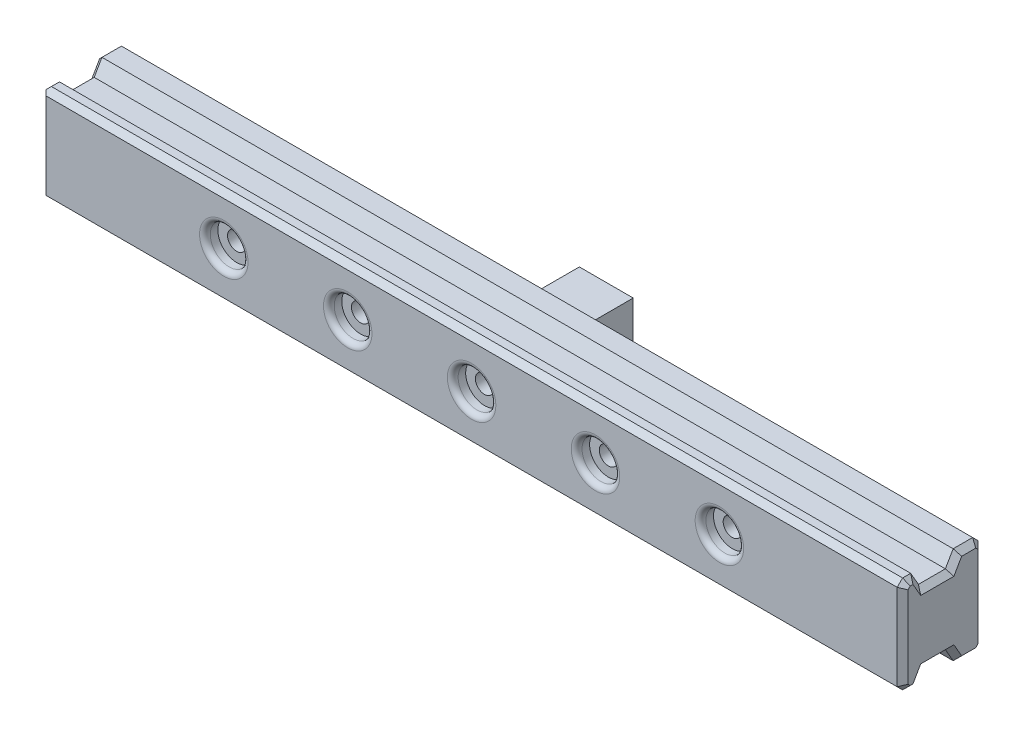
ISO-10303-21;
HEADER;
FILE_DESCRIPTION(('STEP AP214'),'2;1');
FILE_NAME('part.step','',(''),(''),'','','');
FILE_SCHEMA(('AUTOMOTIVE_DESIGN { 1 0 10303 214 1 1 1 1 }'));
ENDSEC;
DATA;
#1=APPLICATION_CONTEXT('core data for automotive mechanical design processes');
#2=APPLICATION_PROTOCOL_DEFINITION('international standard','automotive_design',2000,#1);
#3=PRODUCT_CONTEXT('',#1,'mechanical');
#4=PRODUCT('Part','Part','',(#3));
#5=PRODUCT_RELATED_PRODUCT_CATEGORY('part','',(#4));
#6=PRODUCT_DEFINITION_FORMATION('','',#4);
#7=PRODUCT_DEFINITION_CONTEXT('part definition',#1,'design');
#8=PRODUCT_DEFINITION('design','',#6,#7);
#9=PRODUCT_DEFINITION_SHAPE('','',#8);
#10=(LENGTH_UNIT() NAMED_UNIT(*) SI_UNIT(.MILLI.,.METRE.));
#11=(NAMED_UNIT(*) PLANE_ANGLE_UNIT() SI_UNIT($,.RADIAN.));
#12=(NAMED_UNIT(*) SI_UNIT($,.STERADIAN.) SOLID_ANGLE_UNIT());
#13=UNCERTAINTY_MEASURE_WITH_UNIT(LENGTH_MEASURE(1.E-05),#10,'distance_accuracy_value','');
#14=(GEOMETRIC_REPRESENTATION_CONTEXT(3) GLOBAL_UNCERTAINTY_ASSIGNED_CONTEXT((#13)) GLOBAL_UNIT_ASSIGNED_CONTEXT((#10,
#11,#12)) REPRESENTATION_CONTEXT('',''));
#15=CARTESIAN_POINT('',(0.,0.,0.));
#16=DIRECTION('',(0.,0.,1.));
#17=DIRECTION('',(1.,0.,0.));
#18=AXIS2_PLACEMENT_3D('',#15,#16,#17);
#19=CARTESIAN_POINT('',(0.,0.,0.));
#20=DIRECTION('',(0.,0.,1.));
#21=DIRECTION('',(1.,0.,0.));
#22=AXIS2_PLACEMENT_3D('',#19,#20,#21);
#23=PLANE('',#22);
#24=CARTESIAN_POINT('',(-46.,0.,0.));
#25=DIRECTION('',(0.,0.,1.));
#26=DIRECTION('',(1.,0.,0.));
#27=AXIS2_PLACEMENT_3D('',#24,#25,#26);
#28=CIRCLE('',#27,1.70000000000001);
#29=CARTESIAN_POINT('',(-44.3,0.,0.));
#30=VERTEX_POINT('',#29);
#31=EDGE_CURVE('E952',#30,#30,#28,.T.);
#32=ORIENTED_EDGE('',*,*,#31,.T.);
#33=EDGE_LOOP('',(#32));
#34=FACE_BOUND('',#33,.T.);
#35=CARTESIAN_POINT('',(-23.,0.,0.));
#36=DIRECTION('',(0.,0.,1.));
#37=DIRECTION('',(1.,0.,0.));
#38=AXIS2_PLACEMENT_3D('',#35,#36,#37);
#39=CIRCLE('',#38,1.70000000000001);
#40=CARTESIAN_POINT('',(-21.3,0.,0.));
#41=VERTEX_POINT('',#40);
#42=EDGE_CURVE('E962',#41,#41,#39,.T.);
#43=ORIENTED_EDGE('',*,*,#42,.T.);
#44=EDGE_LOOP('',(#43));
#45=FACE_BOUND('',#44,.T.);
#46=CARTESIAN_POINT('',(46.,0.,0.));
#47=DIRECTION('',(0.,0.,1.));
#48=DIRECTION('',(1.,0.,0.));
#49=AXIS2_PLACEMENT_3D('',#46,#47,#48);
#50=CIRCLE('',#49,1.70000000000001);
#51=CARTESIAN_POINT('',(47.7,0.,0.));
#52=VERTEX_POINT('',#51);
#53=EDGE_CURVE('E781',#52,#52,#50,.T.);
#54=ORIENTED_EDGE('',*,*,#53,.T.);
#55=EDGE_LOOP('',(#54));
#56=FACE_BOUND('',#55,.T.);
#57=CARTESIAN_POINT('',(23.,0.,0.));
#58=DIRECTION('',(0.,0.,1.));
#59=DIRECTION('',(1.,0.,0.));
#60=AXIS2_PLACEMENT_3D('',#57,#58,#59);
#61=CIRCLE('',#60,1.70000000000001);
#62=CARTESIAN_POINT('',(24.7,0.,0.));
#63=VERTEX_POINT('',#62);
#64=EDGE_CURVE('E784',#63,#63,#61,.T.);
#65=ORIENTED_EDGE('',*,*,#64,.T.);
#66=EDGE_LOOP('',(#65));
#67=FACE_BOUND('',#66,.T.);
#68=DIRECTION('',(1.,0.,0.));
#69=VECTOR('',#68,1.);
#70=CARTESIAN_POINT('',(0.,8.,0.));
#71=LINE('',#70,#69);
#72=CARTESIAN_POINT('',(-79.,8.,0.));
#73=VERTEX_POINT('',#72);
#74=CARTESIAN_POINT('',(79.,8.,0.));
#75=VERTEX_POINT('',#74);
#76=EDGE_CURVE('E323',#73,#75,#71,.T.);
#77=ORIENTED_EDGE('',*,*,#76,.T.);
#78=DIRECTION('',(0.,-1.,0.));
#79=VECTOR('',#78,1.);
#80=CARTESIAN_POINT('',(79.,0.,0.));
#81=LINE('',#80,#79);
#82=CARTESIAN_POINT('',(79.,-8.,0.));
#83=VERTEX_POINT('',#82);
#84=EDGE_CURVE('E439',#75,#83,#81,.T.);
#85=ORIENTED_EDGE('',*,*,#84,.T.);
#86=DIRECTION('',(-1.,0.,0.));
#87=VECTOR('',#86,1.);
#88=CARTESIAN_POINT('',(0.,-8.,0.));
#89=LINE('',#88,#87);
#90=CARTESIAN_POINT('',(-79.,-8.,0.));
#91=VERTEX_POINT('',#90);
#92=EDGE_CURVE('E326',#83,#91,#89,.T.);
#93=ORIENTED_EDGE('',*,*,#92,.T.);
#94=DIRECTION('',(0.,1.,0.));
#95=VECTOR('',#94,1.);
#96=CARTESIAN_POINT('',(-79.,0.,0.));
#97=LINE('',#96,#95);
#98=EDGE_CURVE('E437',#91,#73,#97,.T.);
#99=ORIENTED_EDGE('',*,*,#98,.T.);
#100=EDGE_LOOP('',(#77,#85,#93,#99));
#101=FACE_BOUND('',#100,.T.);
#102=DIRECTION('',(0.,1.,0.));
#103=VECTOR('',#102,1.);
#104=CARTESIAN_POINT('',(-5.,5.,0.));
#105=LINE('',#104,#103);
#106=CARTESIAN_POINT('',(-5.,-5.,0.));
#107=VERTEX_POINT('',#106);
#108=CARTESIAN_POINT('',(-5.,5.,0.));
#109=VERTEX_POINT('',#108);
#110=EDGE_CURVE('E290',#107,#109,#105,.T.);
#111=ORIENTED_EDGE('',*,*,#110,.F.);
#112=DIRECTION('',(-1.,0.,0.));
#113=VECTOR('',#112,1.);
#114=CARTESIAN_POINT('',(5.,-5.,0.));
#115=LINE('',#114,#113);
#116=CARTESIAN_POINT('',(5.,-5.,0.));
#117=VERTEX_POINT('',#116);
#118=EDGE_CURVE('E287',#117,#107,#115,.T.);
#119=ORIENTED_EDGE('',*,*,#118,.F.);
#120=DIRECTION('',(0.,-1.,0.));
#121=VECTOR('',#120,1.);
#122=CARTESIAN_POINT('',(5.,5.,0.));
#123=LINE('',#122,#121);
#124=CARTESIAN_POINT('',(5.,5.,0.));
#125=VERTEX_POINT('',#124);
#126=EDGE_CURVE('E807',#125,#117,#123,.T.);
#127=ORIENTED_EDGE('',*,*,#126,.F.);
#128=DIRECTION('',(1.,0.,0.));
#129=VECTOR('',#128,1.);
#130=CARTESIAN_POINT('',(5.,5.,0.));
#131=LINE('',#130,#129);
#132=EDGE_CURVE('E805',#109,#125,#131,.T.);
#133=ORIENTED_EDGE('',*,*,#132,.F.);
#134=EDGE_LOOP('',(#111,#119,#127,#133));
#135=FACE_BOUND('',#134,.T.);
#136=ADVANCED_FACE('F35',(#34,#45,#56,#67,#101,#135),#23,.F.);
#137=CARTESIAN_POINT('',(-80.,-9.,15.));
#138=DIRECTION('',(0.,1.,0.));
#139=DIRECTION('',(-1.,0.,0.));
#140=AXIS2_PLACEMENT_3D('',#137,#138,#139);
#141=PLANE('',#140);
#142=DIRECTION('',(1.,0.,0.));
#143=VECTOR('',#142,1.);
#144=CARTESIAN_POINT('',(-80.001,-9.,12.5));
#145=LINE('',#144,#143);
#146=CARTESIAN_POINT('',(-79.,-9.,12.5));
#147=VERTEX_POINT('',#146);
#148=CARTESIAN_POINT('',(79.,-9.,12.5));
#149=VERTEX_POINT('',#148);
#150=EDGE_CURVE('E291',#147,#149,#145,.T.);
#151=ORIENTED_EDGE('',*,*,#150,.T.);
#152=DIRECTION('',(0.,0.,1.));
#153=VECTOR('',#152,1.);
#154=CARTESIAN_POINT('',(79.,-9.,15.));
#155=LINE('',#154,#153);
#156=CARTESIAN_POINT('',(79.,-9.,14.));
#157=VERTEX_POINT('',#156);
#158=EDGE_CURVE('E393',#149,#157,#155,.T.);
#159=ORIENTED_EDGE('',*,*,#158,.T.);
#160=DIRECTION('',(-1.,0.,0.));
#161=VECTOR('',#160,1.);
#162=CARTESIAN_POINT('',(-80.,-9.,14.));
#163=LINE('',#162,#161);
#164=CARTESIAN_POINT('',(-79.,-9.,14.));
#165=VERTEX_POINT('',#164);
#166=EDGE_CURVE('E338',#157,#165,#163,.T.);
#167=ORIENTED_EDGE('',*,*,#166,.T.);
#168=DIRECTION('',(0.,0.,-1.));
#169=VECTOR('',#168,1.);
#170=CARTESIAN_POINT('',(-79.,-9.,15.));
#171=LINE('',#170,#169);
#172=EDGE_CURVE('E390',#165,#147,#171,.T.);
#173=ORIENTED_EDGE('',*,*,#172,.T.);
#174=EDGE_LOOP('',(#151,#159,#167,#173));
#175=FACE_BOUND('',#174,.T.);
#176=ADVANCED_FACE('F598',(#175),#141,.F.);
#177=CARTESIAN_POINT('',(-80.,9.,15.));
#178=DIRECTION('',(0.,-1.,0.));
#179=DIRECTION('',(0.,0.,-1.));
#180=AXIS2_PLACEMENT_3D('',#177,#178,#179);
#181=PLANE('',#180);
#182=DIRECTION('',(1.,0.,0.));
#183=VECTOR('',#182,1.);
#184=CARTESIAN_POINT('',(-80.001,9.,4.61324865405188));
#185=LINE('',#184,#183);
#186=CARTESIAN_POINT('',(-79.,9.,4.61324865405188));
#187=VERTEX_POINT('',#186);
#188=CARTESIAN_POINT('',(79.,9.,4.61324865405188));
#189=VERTEX_POINT('',#188);
#190=EDGE_CURVE('E309',#187,#189,#185,.T.);
#191=ORIENTED_EDGE('',*,*,#190,.T.);
#192=DIRECTION('',(0.,0.,-1.));
#193=VECTOR('',#192,1.);
#194=CARTESIAN_POINT('',(79.,9.,15.));
#195=LINE('',#194,#193);
#196=CARTESIAN_POINT('',(79.,9.,1.));
#197=VERTEX_POINT('',#196);
#198=EDGE_CURVE('E429',#189,#197,#195,.T.);
#199=ORIENTED_EDGE('',*,*,#198,.T.);
#200=DIRECTION('',(-1.,0.,0.));
#201=VECTOR('',#200,1.);
#202=CARTESIAN_POINT('',(-80.,9.,1.));
#203=LINE('',#202,#201);
#204=CARTESIAN_POINT('',(-79.,9.,1.));
#205=VERTEX_POINT('',#204);
#206=EDGE_CURVE('E329',#197,#205,#203,.T.);
#207=ORIENTED_EDGE('',*,*,#206,.T.);
#208=DIRECTION('',(0.,0.,1.));
#209=VECTOR('',#208,1.);
#210=CARTESIAN_POINT('',(-79.,9.,15.));
#211=LINE('',#210,#209);
#212=EDGE_CURVE('E427',#205,#187,#211,.T.);
#213=ORIENTED_EDGE('',*,*,#212,.T.);
#214=EDGE_LOOP('',(#191,#199,#207,#213));
#215=FACE_BOUND('',#214,.T.);
#216=ADVANCED_FACE('F604',(#215),#181,.F.);
#217=CARTESIAN_POINT('',(80.,9.,15.));
#218=DIRECTION('',(-1.,0.,0.));
#219=DIRECTION('',(0.,0.,1.));
#220=AXIS2_PLACEMENT_3D('',#217,#218,#219);
#221=PLANE('',#220);
#222=DIRECTION('',(0.,0.,-1.));
#223=VECTOR('',#222,1.);
#224=CARTESIAN_POINT('',(80.,-5.49999999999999,15.));
#225=LINE('',#224,#223);
#226=CARTESIAN_POINT('',(80.,-5.49999999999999,11.6339745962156));
#227=VERTEX_POINT('',#226);
#228=CARTESIAN_POINT('',(80.,-5.49999999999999,5.4792740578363));
#229=VERTEX_POINT('',#228);
#230=EDGE_CURVE('E377',#227,#229,#225,.T.);
#231=ORIENTED_EDGE('',*,*,#230,.T.);
#232=DIRECTION('',(0.,-0.866025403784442,-0.499999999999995));
#233=VECTOR('',#232,1.);
#234=CARTESIAN_POINT('',(80.,9.4975952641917,14.1381397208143));
#235=LINE('',#234,#233);
#236=CARTESIAN_POINT('',(80.,-8.,4.03589838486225));
#237=VERTEX_POINT('',#236);
#238=EDGE_CURVE('E379',#229,#237,#235,.T.);
#239=ORIENTED_EDGE('',*,*,#238,.T.);
#240=DIRECTION('',(0.,0.,-1.));
#241=VECTOR('',#240,1.);
#242=CARTESIAN_POINT('',(80.,-8.,15.));
#243=LINE('',#242,#241);
#244=CARTESIAN_POINT('',(80.,-8.,1.4142135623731));
#245=VERTEX_POINT('',#244);
#246=EDGE_CURVE('E349',#237,#245,#243,.T.);
#247=ORIENTED_EDGE('',*,*,#246,.T.);
#248=DIRECTION('',(0.,0.707106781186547,-0.707106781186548));
#249=VECTOR('',#248,1.);
#250=CARTESIAN_POINT('',(80.,-7.29289321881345,0.707106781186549));
#251=LINE('',#250,#249);
#252=CARTESIAN_POINT('',(80.,-7.5857864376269,1.));
#253=VERTEX_POINT('',#252);
#254=EDGE_CURVE('E351',#245,#253,#251,.T.);
#255=ORIENTED_EDGE('',*,*,#254,.T.);
#256=DIRECTION('',(0.,1.,0.));
#257=VECTOR('',#256,1.);
#258=CARTESIAN_POINT('',(80.,9.,1.));
#259=LINE('',#258,#257);
#260=CARTESIAN_POINT('',(80.,7.5857864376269,1.));
#261=VERTEX_POINT('',#260);
#262=EDGE_CURVE('E353',#253,#261,#259,.T.);
#263=ORIENTED_EDGE('',*,*,#262,.T.);
#264=DIRECTION('',(0.,0.707106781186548,0.707106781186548));
#265=VECTOR('',#264,1.);
#266=CARTESIAN_POINT('',(80.,8.29289321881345,1.70710678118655));
#267=LINE('',#266,#265);
#268=CARTESIAN_POINT('',(80.,8.,1.4142135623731));
#269=VERTEX_POINT('',#268);
#270=EDGE_CURVE('E355',#261,#269,#267,.T.);
#271=ORIENTED_EDGE('',*,*,#270,.T.);
#272=DIRECTION('',(0.,0.,1.));
#273=VECTOR('',#272,1.);
#274=CARTESIAN_POINT('',(80.,8.,15.));
#275=LINE('',#274,#273);
#276=CARTESIAN_POINT('',(80.,8.,4.03589838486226));
#277=VERTEX_POINT('',#276);
#278=EDGE_CURVE('E357',#269,#277,#275,.T.);
#279=ORIENTED_EDGE('',*,*,#278,.T.);
#280=DIRECTION('',(0.,-0.866025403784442,0.499999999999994));
#281=VECTOR('',#280,1.);
#282=CARTESIAN_POINT('',(80.,4.0024047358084,6.34391108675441));
#283=LINE('',#282,#281);
#284=CARTESIAN_POINT('',(80.,5.49999999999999,5.4792740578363));
#285=VERTEX_POINT('',#284);
#286=EDGE_CURVE('E359',#277,#285,#283,.T.);
#287=ORIENTED_EDGE('',*,*,#286,.T.);
#288=DIRECTION('',(0.,0.,1.));
#289=VECTOR('',#288,1.);
#290=CARTESIAN_POINT('',(80.,5.5,15.));
#291=LINE('',#290,#289);
#292=CARTESIAN_POINT('',(80.,5.49999999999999,11.6339745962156));
#293=VERTEX_POINT('',#292);
#294=EDGE_CURVE('E361',#285,#293,#291,.T.);
#295=ORIENTED_EDGE('',*,*,#294,.T.);
#296=DIRECTION('',(0.,0.866025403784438,0.500000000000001));
#297=VECTOR('',#296,1.);
#298=CARTESIAN_POINT('',(80.,9.58253175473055,13.9910254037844));
#299=LINE('',#298,#297);
#300=CARTESIAN_POINT('',(80.,8.,13.0773502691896));
#301=VERTEX_POINT('',#300);
#302=EDGE_CURVE('E363',#293,#301,#299,.T.);
#303=ORIENTED_EDGE('',*,*,#302,.T.);
#304=DIRECTION('',(0.,0.,1.));
#305=VECTOR('',#304,1.);
#306=CARTESIAN_POINT('',(80.,8.,15.));
#307=LINE('',#306,#305);
#308=CARTESIAN_POINT('',(80.,8.,13.5857864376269));
#309=VERTEX_POINT('',#308);
#310=EDGE_CURVE('E365',#301,#309,#307,.T.);
#311=ORIENTED_EDGE('',*,*,#310,.T.);
#312=DIRECTION('',(0.,-0.707106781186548,0.707106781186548));
#313=VECTOR('',#312,1.);
#314=CARTESIAN_POINT('',(80.,7.29289321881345,14.2928932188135));
#315=LINE('',#314,#313);
#316=CARTESIAN_POINT('',(80.,7.5857864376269,14.));
#317=VERTEX_POINT('',#316);
#318=EDGE_CURVE('E367',#309,#317,#315,.T.);
#319=ORIENTED_EDGE('',*,*,#318,.T.);
#320=DIRECTION('',(0.,-1.,0.));
#321=VECTOR('',#320,1.);
#322=CARTESIAN_POINT('',(80.,-8.,14.));
#323=LINE('',#322,#321);
#324=CARTESIAN_POINT('',(80.,-7.5857864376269,14.));
#325=VERTEX_POINT('',#324);
#326=EDGE_CURVE('E369',#317,#325,#323,.T.);
#327=ORIENTED_EDGE('',*,*,#326,.T.);
#328=DIRECTION('',(0.,-0.707106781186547,-0.707106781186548));
#329=VECTOR('',#328,1.);
#330=CARTESIAN_POINT('',(80.,-8.29289321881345,13.2928932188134));
#331=LINE('',#330,#329);
#332=CARTESIAN_POINT('',(80.,-8.,13.5857864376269));
#333=VERTEX_POINT('',#332);
#334=EDGE_CURVE('E371',#325,#333,#331,.T.);
#335=ORIENTED_EDGE('',*,*,#334,.T.);
#336=DIRECTION('',(0.,0.,-1.));
#337=VECTOR('',#336,1.);
#338=CARTESIAN_POINT('',(80.,-8.,15.));
#339=LINE('',#338,#337);
#340=CARTESIAN_POINT('',(80.,-8.,13.0773502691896));
#341=VERTEX_POINT('',#340);
#342=EDGE_CURVE('E373',#333,#341,#339,.T.);
#343=ORIENTED_EDGE('',*,*,#342,.T.);
#344=DIRECTION('',(0.,0.866025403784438,-0.500000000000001));
#345=VECTOR('',#344,1.);
#346=CARTESIAN_POINT('',(80.,3.91746824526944,6.19679676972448));
#347=LINE('',#346,#345);
#348=EDGE_CURVE('E375',#341,#227,#347,.T.);
#349=ORIENTED_EDGE('',*,*,#348,.T.);
#350=EDGE_LOOP('',(#231,#239,#247,#255,#263,#271,#279,#287,#295,#303,#311,#319,#327,#335,#343,#349));
#351=FACE_BOUND('',#350,.T.);
#352=ADVANCED_FACE('F622',(#351),#221,.F.);
#353=DIRECTION('',(1.,0.,0.));
#354=VECTOR('',#353,1.);
#355=CARTESIAN_POINT('',(80.,9.,14.));
#356=LINE('',#355,#354);
#357=CARTESIAN_POINT('',(-79.,9.,14.));
#358=VERTEX_POINT('',#357);
#359=CARTESIAN_POINT('',(79.,9.,14.));
#360=VERTEX_POINT('',#359);
#361=EDGE_CURVE('E341',#358,#360,#356,.T.);
#362=ORIENTED_EDGE('',*,*,#361,.T.);
#363=DIRECTION('',(0.,0.,-1.));
#364=VECTOR('',#363,1.);
#365=CARTESIAN_POINT('',(79.,9.,15.));
#366=LINE('',#365,#364);
#367=CARTESIAN_POINT('',(79.,9.,12.5));
#368=VERTEX_POINT('',#367);
#369=EDGE_CURVE('E413',#360,#368,#366,.T.);
#370=ORIENTED_EDGE('',*,*,#369,.T.);
#371=DIRECTION('',(1.,0.,0.));
#372=VECTOR('',#371,1.);
#373=CARTESIAN_POINT('',(-80.001,9.,12.5));
#374=LINE('',#373,#372);
#375=CARTESIAN_POINT('',(-79.,9.,12.5));
#376=VERTEX_POINT('',#375);
#377=EDGE_CURVE('E303',#376,#368,#374,.T.);
#378=ORIENTED_EDGE('',*,*,#377,.F.);
#379=DIRECTION('',(0.,0.,1.));
#380=VECTOR('',#379,1.);
#381=CARTESIAN_POINT('',(-79.,9.,15.));
#382=LINE('',#381,#380);
#383=EDGE_CURVE('E411',#376,#358,#382,.T.);
#384=ORIENTED_EDGE('',*,*,#383,.T.);
#385=EDGE_LOOP('',(#362,#370,#378,#384));
#386=FACE_BOUND('',#385,.T.);
#387=ADVANCED_FACE('F619',(#386),#181,.F.);
#388=CARTESIAN_POINT('',(-80.,9.,15.));
#389=DIRECTION('',(1.,0.,0.));
#390=DIRECTION('',(0.,0.,-1.));
#391=AXIS2_PLACEMENT_3D('',#388,#389,#390);
#392=PLANE('',#391);
#393=DIRECTION('',(0.,0.,-1.));
#394=VECTOR('',#393,1.);
#395=CARTESIAN_POINT('',(-80.,7.99999999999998,15.));
#396=LINE('',#395,#394);
#397=CARTESIAN_POINT('',(-80.,7.99999999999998,14.));
#398=VERTEX_POINT('',#397);
#399=CARTESIAN_POINT('',(-80.,7.99999999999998,13.0773502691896));
#400=VERTEX_POINT('',#399);
#401=EDGE_CURVE('E55',#398,#400,#396,.T.);
#402=ORIENTED_EDGE('',*,*,#401,.T.);
#403=DIRECTION('',(0.,-0.866025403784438,-0.500000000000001));
#404=VECTOR('',#403,1.);
#405=CARTESIAN_POINT('',(-80.,9.58253175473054,13.9910254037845));
#406=LINE('',#405,#404);
#407=CARTESIAN_POINT('',(-80.,5.49999999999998,11.6339745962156));
#408=VERTEX_POINT('',#407);
#409=EDGE_CURVE('E50',#400,#408,#406,.T.);
#410=ORIENTED_EDGE('',*,*,#409,.T.);
#411=DIRECTION('',(0.,0.,-1.));
#412=VECTOR('',#411,1.);
#413=CARTESIAN_POINT('',(-80.,5.49999999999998,15.));
#414=LINE('',#413,#412);
#415=CARTESIAN_POINT('',(-80.,5.49999999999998,5.47927405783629));
#416=VERTEX_POINT('',#415);
#417=EDGE_CURVE('E471',#408,#416,#414,.T.);
#418=ORIENTED_EDGE('',*,*,#417,.T.);
#419=DIRECTION('',(0.,0.866025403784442,-0.499999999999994));
#420=VECTOR('',#419,1.);
#421=CARTESIAN_POINT('',(-80.,4.0024047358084,6.3439110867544));
#422=LINE('',#421,#420);
#423=CARTESIAN_POINT('',(-80.,7.99999999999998,4.03589838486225));
#424=VERTEX_POINT('',#423);
#425=EDGE_CURVE('E468',#416,#424,#422,.T.);
#426=ORIENTED_EDGE('',*,*,#425,.T.);
#427=DIRECTION('',(0.,0.,-1.));
#428=VECTOR('',#427,1.);
#429=CARTESIAN_POINT('',(-80.,7.99999999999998,15.));
#430=LINE('',#429,#428);
#431=CARTESIAN_POINT('',(-80.,7.99999999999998,1.));
#432=VERTEX_POINT('',#431);
#433=EDGE_CURVE('E453',#424,#432,#430,.T.);
#434=ORIENTED_EDGE('',*,*,#433,.T.);
#435=DIRECTION('',(0.,-1.,0.));
#436=VECTOR('',#435,1.);
#437=CARTESIAN_POINT('',(-80.,9.,1.));
#438=LINE('',#437,#436);
#439=CARTESIAN_POINT('',(-80.,-8.00000000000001,1.));
#440=VERTEX_POINT('',#439);
#441=EDGE_CURVE('E451',#432,#440,#438,.T.);
#442=ORIENTED_EDGE('',*,*,#441,.T.);
#443=DIRECTION('',(0.,0.,1.));
#444=VECTOR('',#443,1.);
#445=CARTESIAN_POINT('',(-80.,-8.00000000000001,15.));
#446=LINE('',#445,#444);
#447=CARTESIAN_POINT('',(-80.,-8.00000000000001,4.03589838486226));
#448=VERTEX_POINT('',#447);
#449=EDGE_CURVE('E455',#440,#448,#446,.T.);
#450=ORIENTED_EDGE('',*,*,#449,.T.);
#451=DIRECTION('',(0.,0.866025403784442,0.499999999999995));
#452=VECTOR('',#451,1.);
#453=CARTESIAN_POINT('',(-80.,9.49759526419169,14.1381397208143));
#454=LINE('',#453,#452);
#455=CARTESIAN_POINT('',(-80.,-5.50000000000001,5.47927405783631));
#456=VERTEX_POINT('',#455);
#457=EDGE_CURVE('E457',#448,#456,#454,.T.);
#458=ORIENTED_EDGE('',*,*,#457,.T.);
#459=DIRECTION('',(0.,0.,1.));
#460=VECTOR('',#459,1.);
#461=CARTESIAN_POINT('',(-80.,-5.50000000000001,15.));
#462=LINE('',#461,#460);
#463=CARTESIAN_POINT('',(-80.,-5.50000000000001,11.6339745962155));
#464=VERTEX_POINT('',#463);
#465=EDGE_CURVE('E459',#456,#464,#462,.T.);
#466=ORIENTED_EDGE('',*,*,#465,.T.);
#467=DIRECTION('',(0.,-0.866025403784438,0.500000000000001));
#468=VECTOR('',#467,1.);
#469=CARTESIAN_POINT('',(-80.,3.91746824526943,6.19679676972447));
#470=LINE('',#469,#468);
#471=CARTESIAN_POINT('',(-80.,-8.00000000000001,13.0773502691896));
#472=VERTEX_POINT('',#471);
#473=EDGE_CURVE('E461',#464,#472,#470,.T.);
#474=ORIENTED_EDGE('',*,*,#473,.T.);
#475=DIRECTION('',(0.,0.,1.));
#476=VECTOR('',#475,1.);
#477=CARTESIAN_POINT('',(-80.,-8.00000000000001,15.));
#478=LINE('',#477,#476);
#479=CARTESIAN_POINT('',(-80.,-8.00000000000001,14.));
#480=VERTEX_POINT('',#479);
#481=EDGE_CURVE('E463',#472,#480,#478,.T.);
#482=ORIENTED_EDGE('',*,*,#481,.T.);
#483=DIRECTION('',(0.,1.,0.));
#484=VECTOR('',#483,1.);
#485=CARTESIAN_POINT('',(-80.,8.,14.));
#486=LINE('',#485,#484);
#487=EDGE_CURVE('E466',#480,#398,#486,.T.);
#488=ORIENTED_EDGE('',*,*,#487,.T.);
#489=EDGE_LOOP('',(#402,#410,#418,#426,#434,#442,#450,#458,#466,#474,#482,#488));
#490=FACE_BOUND('',#489,.T.);
#491=ADVANCED_FACE('F615',(#490),#392,.F.);
#492=DIRECTION('',(1.,0.,0.));
#493=VECTOR('',#492,1.);
#494=CARTESIAN_POINT('',(-80.,-9.,1.));
#495=LINE('',#494,#493);
#496=CARTESIAN_POINT('',(-79.,-9.,1.));
#497=VERTEX_POINT('',#496);
#498=CARTESIAN_POINT('',(79.,-9.,1.));
#499=VERTEX_POINT('',#498);
#500=EDGE_CURVE('E312',#497,#499,#495,.T.);
#501=ORIENTED_EDGE('',*,*,#500,.T.);
#502=DIRECTION('',(0.,0.,1.));
#503=VECTOR('',#502,1.);
#504=CARTESIAN_POINT('',(79.,-9.,15.));
#505=LINE('',#504,#503);
#506=CARTESIAN_POINT('',(79.,-9.,4.61324865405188));
#507=VERTEX_POINT('',#506);
#508=EDGE_CURVE('E449',#499,#507,#505,.T.);
#509=ORIENTED_EDGE('',*,*,#508,.T.);
#510=DIRECTION('',(1.,0.,0.));
#511=VECTOR('',#510,1.);
#512=CARTESIAN_POINT('',(-80.001,-9.,4.61324865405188));
#513=LINE('',#512,#511);
#514=CARTESIAN_POINT('',(-79.,-9.,4.61324865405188));
#515=VERTEX_POINT('',#514);
#516=EDGE_CURVE('E294',#515,#507,#513,.T.);
#517=ORIENTED_EDGE('',*,*,#516,.F.);
#518=DIRECTION('',(0.,0.,-1.));
#519=VECTOR('',#518,1.);
#520=CARTESIAN_POINT('',(-79.,-9.,15.));
#521=LINE('',#520,#519);
#522=EDGE_CURVE('E447',#515,#497,#521,.T.);
#523=ORIENTED_EDGE('',*,*,#522,.T.);
#524=EDGE_LOOP('',(#501,#509,#517,#523));
#525=FACE_BOUND('',#524,.T.);
#526=ADVANCED_FACE('F607',(#525),#141,.F.);
#527=CARTESIAN_POINT('',(0.,0.,15.));
#528=DIRECTION('',(0.,0.,1.));
#529=DIRECTION('',(1.,0.,0.));
#530=AXIS2_PLACEMENT_3D('',#527,#528,#529);
#531=PLANE('',#530);
#532=CARTESIAN_POINT('',(46.,0.,15.));
#533=DIRECTION('',(0.,0.,1.));
#534=DIRECTION('',(1.,0.,0.));
#535=AXIS2_PLACEMENT_3D('',#532,#533,#534);
#536=CIRCLE('',#535,4.5);
#537=CARTESIAN_POINT('',(50.5,0.,15.));
#538=VERTEX_POINT('',#537);
#539=EDGE_CURVE('E570',#538,#538,#536,.F.);
#540=ORIENTED_EDGE('',*,*,#539,.T.);
#541=EDGE_LOOP('',(#540));
#542=FACE_BOUND('',#541,.T.);
#543=CARTESIAN_POINT('',(23.,0.,15.));
#544=DIRECTION('',(0.,0.,1.));
#545=DIRECTION('',(1.,0.,0.));
#546=AXIS2_PLACEMENT_3D('',#543,#544,#545);
#547=CIRCLE('',#546,4.5);
#548=CARTESIAN_POINT('',(27.5,0.,15.));
#549=VERTEX_POINT('',#548);
#550=EDGE_CURVE('E567',#549,#549,#547,.F.);
#551=ORIENTED_EDGE('',*,*,#550,.T.);
#552=EDGE_LOOP('',(#551));
#553=FACE_BOUND('',#552,.T.);
#554=CARTESIAN_POINT('',(0.,0.,15.));
#555=DIRECTION('',(0.,0.,1.));
#556=DIRECTION('',(1.,0.,0.));
#557=AXIS2_PLACEMENT_3D('',#554,#555,#556);
#558=CIRCLE('',#557,4.5);
#559=CARTESIAN_POINT('',(4.5,0.,15.));
#560=VERTEX_POINT('',#559);
#561=EDGE_CURVE('E564',#560,#560,#558,.F.);
#562=ORIENTED_EDGE('',*,*,#561,.T.);
#563=EDGE_LOOP('',(#562));
#564=FACE_BOUND('',#563,.T.);
#565=CARTESIAN_POINT('',(-23.,0.,15.));
#566=DIRECTION('',(0.,0.,1.));
#567=DIRECTION('',(1.,0.,0.));
#568=AXIS2_PLACEMENT_3D('',#565,#566,#567);
#569=CIRCLE('',#568,4.5);
#570=CARTESIAN_POINT('',(-18.5,0.,15.));
#571=VERTEX_POINT('',#570);
#572=EDGE_CURVE('E561',#571,#571,#569,.F.);
#573=ORIENTED_EDGE('',*,*,#572,.T.);
#574=EDGE_LOOP('',(#573));
#575=FACE_BOUND('',#574,.T.);
#576=CARTESIAN_POINT('',(-46.,0.,15.));
#577=DIRECTION('',(0.,0.,1.));
#578=DIRECTION('',(1.,0.,0.));
#579=AXIS2_PLACEMENT_3D('',#576,#577,#578);
#580=CIRCLE('',#579,4.5);
#581=CARTESIAN_POINT('',(-41.5,0.,15.));
#582=VERTEX_POINT('',#581);
#583=EDGE_CURVE('E558',#582,#582,#580,.F.);
#584=ORIENTED_EDGE('',*,*,#583,.T.);
#585=EDGE_LOOP('',(#584));
#586=FACE_BOUND('',#585,.T.);
#587=DIRECTION('',(1.,0.,0.));
#588=VECTOR('',#587,1.);
#589=CARTESIAN_POINT('',(80.,-8.,15.));
#590=LINE('',#589,#588);
#591=CARTESIAN_POINT('',(-79.,-8.,15.));
#592=VERTEX_POINT('',#591);
#593=CARTESIAN_POINT('',(79.,-8.,15.));
#594=VERTEX_POINT('',#593);
#595=EDGE_CURVE('E335',#592,#594,#590,.T.);
#596=ORIENTED_EDGE('',*,*,#595,.T.);
#597=DIRECTION('',(0.,1.,0.));
#598=VECTOR('',#597,1.);
#599=CARTESIAN_POINT('',(79.,8.,15.));
#600=LINE('',#599,#598);
#601=CARTESIAN_POINT('',(79.,8.,15.));
#602=VERTEX_POINT('',#601);
#603=EDGE_CURVE('E403',#594,#602,#600,.T.);
#604=ORIENTED_EDGE('',*,*,#603,.T.);
#605=DIRECTION('',(-1.,0.,0.));
#606=VECTOR('',#605,1.);
#607=CARTESIAN_POINT('',(-80.,8.,15.));
#608=LINE('',#607,#606);
#609=CARTESIAN_POINT('',(-79.,8.,15.));
#610=VERTEX_POINT('',#609);
#611=EDGE_CURVE('E332',#602,#610,#608,.T.);
#612=ORIENTED_EDGE('',*,*,#611,.T.);
#613=DIRECTION('',(0.,-1.,0.));
#614=VECTOR('',#613,1.);
#615=CARTESIAN_POINT('',(-79.,-8.,15.));
#616=LINE('',#615,#614);
#617=EDGE_CURVE('E401',#610,#592,#616,.T.);
#618=ORIENTED_EDGE('',*,*,#617,.T.);
#619=EDGE_LOOP('',(#596,#604,#612,#618));
#620=FACE_BOUND('',#619,.T.);
#621=ADVANCED_FACE('F611',(#542,#553,#564,#575,#586,#620),#531,.T.);
#622=CARTESIAN_POINT('',(-80.001,6.5,6.05662432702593));
#623=DIRECTION('',(0.,-0.499999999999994,-0.866025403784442));
#624=DIRECTION('',(0.,0.866025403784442,-0.499999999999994));
#625=AXIS2_PLACEMENT_3D('',#622,#623,#624);
#626=PLANE('',#625);
#627=DIRECTION('',(1.,0.,0.));
#628=VECTOR('',#627,1.);
#629=CARTESIAN_POINT('',(-80.001,6.5,6.05662432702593));
#630=LINE('',#629,#628);
#631=CARTESIAN_POINT('',(-79.,6.5,6.05662432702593));
#632=VERTEX_POINT('',#631);
#633=CARTESIAN_POINT('',(79.,6.5,6.05662432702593));
#634=VERTEX_POINT('',#633);
#635=EDGE_CURVE('E313',#632,#634,#630,.T.);
#636=ORIENTED_EDGE('',*,*,#635,.T.);
#637=DIRECTION('',(0.,0.866025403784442,-0.499999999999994));
#638=VECTOR('',#637,1.);
#639=CARTESIAN_POINT('',(79.,6.5,6.05662432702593));
#640=LINE('',#639,#638);
#641=EDGE_CURVE('E425',#634,#189,#640,.T.);
#642=ORIENTED_EDGE('',*,*,#641,.T.);
#643=ORIENTED_EDGE('',*,*,#190,.F.);
#644=DIRECTION('',(0.,-0.866025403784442,0.499999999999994));
#645=VECTOR('',#644,1.);
#646=CARTESIAN_POINT('',(-79.,6.5,6.05662432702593));
#647=LINE('',#646,#645);
#648=EDGE_CURVE('E423',#187,#632,#647,.T.);
#649=ORIENTED_EDGE('',*,*,#648,.T.);
#650=EDGE_LOOP('',(#636,#642,#643,#649));
#651=FACE_BOUND('',#650,.T.);
#652=ADVANCED_FACE('F843',(#651),#626,.F.);
#653=CARTESIAN_POINT('',(-80.001,6.5,11.0566243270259));
#654=DIRECTION('',(0.,-1.,0.));
#655=DIRECTION('',(0.,0.,-1.));
#656=AXIS2_PLACEMENT_3D('',#653,#654,#655);
#657=PLANE('',#656);
#658=DIRECTION('',(1.,0.,0.));
#659=VECTOR('',#658,1.);
#660=CARTESIAN_POINT('',(-80.001,6.5,11.0566243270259));
#661=LINE('',#660,#659);
#662=CARTESIAN_POINT('',(-79.,6.5,11.0566243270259));
#663=VERTEX_POINT('',#662);
#664=CARTESIAN_POINT('',(79.,6.5,11.0566243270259));
#665=VERTEX_POINT('',#664);
#666=EDGE_CURVE('E316',#663,#665,#661,.T.);
#667=ORIENTED_EDGE('',*,*,#666,.T.);
#668=DIRECTION('',(0.,0.,-1.));
#669=VECTOR('',#668,1.);
#670=CARTESIAN_POINT('',(79.,6.5,11.0566243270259));
#671=LINE('',#670,#669);
#672=EDGE_CURVE('E421',#665,#634,#671,.T.);
#673=ORIENTED_EDGE('',*,*,#672,.T.);
#674=ORIENTED_EDGE('',*,*,#635,.F.);
#675=DIRECTION('',(0.,0.,1.));
#676=VECTOR('',#675,1.);
#677=CARTESIAN_POINT('',(-79.,6.5,11.0566243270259));
#678=LINE('',#677,#676);
#679=EDGE_CURVE('E419',#632,#663,#678,.T.);
#680=ORIENTED_EDGE('',*,*,#679,.T.);
#681=EDGE_LOOP('',(#667,#673,#674,#680));
#682=FACE_BOUND('',#681,.T.);
#683=ADVANCED_FACE('F846',(#682),#657,.F.);
#684=CARTESIAN_POINT('',(-80.001,9.,12.5));
#685=DIRECTION('',(0.,-0.500000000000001,0.866025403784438));
#686=DIRECTION('',(0.,-0.866025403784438,-0.500000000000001));
#687=AXIS2_PLACEMENT_3D('',#684,#685,#686);
#688=PLANE('',#687);
#689=ORIENTED_EDGE('',*,*,#377,.T.);
#690=DIRECTION('',(0.,-0.866025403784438,-0.500000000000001));
#691=VECTOR('',#690,1.);
#692=CARTESIAN_POINT('',(79.,9.,12.5));
#693=LINE('',#692,#691);
#694=EDGE_CURVE('E417',#368,#665,#693,.T.);
#695=ORIENTED_EDGE('',*,*,#694,.T.);
#696=ORIENTED_EDGE('',*,*,#666,.F.);
#697=DIRECTION('',(0.,0.866025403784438,0.500000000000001));
#698=VECTOR('',#697,1.);
#699=CARTESIAN_POINT('',(-79.,9.,12.5));
#700=LINE('',#699,#698);
#701=EDGE_CURVE('E415',#663,#376,#700,.T.);
#702=ORIENTED_EDGE('',*,*,#701,.T.);
#703=EDGE_LOOP('',(#689,#695,#696,#702));
#704=FACE_BOUND('',#703,.T.);
#705=ADVANCED_FACE('F841',(#704),#688,.F.);
#706=CARTESIAN_POINT('',(-80.001,-9.,12.5));
#707=DIRECTION('',(0.,0.500000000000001,0.866025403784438));
#708=DIRECTION('',(0.,-0.866025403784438,0.500000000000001));
#709=AXIS2_PLACEMENT_3D('',#706,#707,#708);
#710=PLANE('',#709);
#711=DIRECTION('',(1.,0.,0.));
#712=VECTOR('',#711,1.);
#713=CARTESIAN_POINT('',(-80.001,-6.5,11.0566243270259));
#714=LINE('',#713,#712);
#715=CARTESIAN_POINT('',(-79.,-6.5,11.0566243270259));
#716=VERTEX_POINT('',#715);
#717=CARTESIAN_POINT('',(79.,-6.5,11.0566243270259));
#718=VERTEX_POINT('',#717);
#719=EDGE_CURVE('E300',#716,#718,#714,.T.);
#720=ORIENTED_EDGE('',*,*,#719,.T.);
#721=DIRECTION('',(0.,-0.866025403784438,0.500000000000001));
#722=VECTOR('',#721,1.);
#723=CARTESIAN_POINT('',(79.,-9.,12.5));
#724=LINE('',#723,#722);
#725=EDGE_CURVE('E388',#718,#149,#724,.T.);
#726=ORIENTED_EDGE('',*,*,#725,.T.);
#727=ORIENTED_EDGE('',*,*,#150,.F.);
#728=DIRECTION('',(0.,0.866025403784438,-0.500000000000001));
#729=VECTOR('',#728,1.);
#730=CARTESIAN_POINT('',(-79.,-9.,12.5));
#731=LINE('',#730,#729);
#732=EDGE_CURVE('E386',#147,#716,#731,.T.);
#733=ORIENTED_EDGE('',*,*,#732,.T.);
#734=EDGE_LOOP('',(#720,#726,#727,#733));
#735=FACE_BOUND('',#734,.T.);
#736=ADVANCED_FACE('F834',(#735),#710,.F.);
#737=CARTESIAN_POINT('',(-80.001,-6.5,11.0566243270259));
#738=DIRECTION('',(0.,1.,0.));
#739=DIRECTION('',(0.,0.,1.));
#740=AXIS2_PLACEMENT_3D('',#737,#738,#739);
#741=PLANE('',#740);
#742=DIRECTION('',(1.,0.,0.));
#743=VECTOR('',#742,1.);
#744=CARTESIAN_POINT('',(-80.001,-6.5,6.05662432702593));
#745=LINE('',#744,#743);
#746=CARTESIAN_POINT('',(-79.,-6.5,6.05662432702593));
#747=VERTEX_POINT('',#746);
#748=CARTESIAN_POINT('',(79.,-6.5,6.05662432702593));
#749=VERTEX_POINT('',#748);
#750=EDGE_CURVE('E304',#747,#749,#745,.T.);
#751=ORIENTED_EDGE('',*,*,#750,.T.);
#752=DIRECTION('',(0.,0.,1.));
#753=VECTOR('',#752,1.);
#754=CARTESIAN_POINT('',(79.,-6.5,11.0566243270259));
#755=LINE('',#754,#753);
#756=EDGE_CURVE('E384',#749,#718,#755,.T.);
#757=ORIENTED_EDGE('',*,*,#756,.T.);
#758=ORIENTED_EDGE('',*,*,#719,.F.);
#759=DIRECTION('',(0.,0.,-1.));
#760=VECTOR('',#759,1.);
#761=CARTESIAN_POINT('',(-79.,-6.5,11.0566243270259));
#762=LINE('',#761,#760);
#763=EDGE_CURVE('E382',#716,#747,#762,.T.);
#764=ORIENTED_EDGE('',*,*,#763,.T.);
#765=EDGE_LOOP('',(#751,#757,#758,#764));
#766=FACE_BOUND('',#765,.T.);
#767=ADVANCED_FACE('F831',(#766),#741,.F.);
#768=CARTESIAN_POINT('',(-80.001,-6.5,6.05662432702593));
#769=DIRECTION('',(0.,0.499999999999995,-0.866025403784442));
#770=DIRECTION('',(0.,0.866025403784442,0.499999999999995));
#771=AXIS2_PLACEMENT_3D('',#768,#769,#770);
#772=PLANE('',#771);
#773=ORIENTED_EDGE('',*,*,#516,.T.);
#774=DIRECTION('',(0.,0.866025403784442,0.499999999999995));
#775=VECTOR('',#774,1.);
#776=CARTESIAN_POINT('',(79.,-6.5,6.05662432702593));
#777=LINE('',#776,#775);
#778=EDGE_CURVE('E346',#507,#749,#777,.T.);
#779=ORIENTED_EDGE('',*,*,#778,.T.);
#780=ORIENTED_EDGE('',*,*,#750,.F.);
#781=DIRECTION('',(0.,-0.866025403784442,-0.499999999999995));
#782=VECTOR('',#781,1.);
#783=CARTESIAN_POINT('',(-79.,-6.5,6.05662432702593));
#784=LINE('',#783,#782);
#785=EDGE_CURVE('E344',#747,#515,#784,.T.);
#786=ORIENTED_EDGE('',*,*,#785,.T.);
#787=EDGE_LOOP('',(#773,#779,#780,#786));
#788=FACE_BOUND('',#787,.T.);
#789=ADVANCED_FACE('F631',(#788),#772,.F.);
#790=CARTESIAN_POINT('',(-80.,-9.,1.));
#791=DIRECTION('',(0.,0.707106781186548,0.707106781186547));
#792=DIRECTION('',(1.,0.,0.));
#793=AXIS2_PLACEMENT_3D('',#790,#791,#792);
#794=PLANE('',#793);
#795=ORIENTED_EDGE('',*,*,#92,.F.);
#796=DIRECTION('',(0.,0.707106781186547,-0.707106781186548));
#797=VECTOR('',#796,1.);
#798=CARTESIAN_POINT('',(79.,-9.,1.));
#799=LINE('',#798,#797);
#800=EDGE_CURVE('E445',#83,#499,#799,.F.);
#801=ORIENTED_EDGE('',*,*,#800,.T.);
#802=ORIENTED_EDGE('',*,*,#500,.F.);
#803=DIRECTION('',(-0.577350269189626,0.577350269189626,-0.577350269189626));
#804=VECTOR('',#803,1.);
#805=CARTESIAN_POINT('',(-79.3333333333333,-8.66666666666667,0.666666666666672));
#806=LINE('',#805,#804);
#807=CARTESIAN_POINT('',(-79.5,-8.5,0.500000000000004));
#808=VERTEX_POINT('',#807);
#809=EDGE_CURVE('E443',#497,#808,#806,.T.);
#810=ORIENTED_EDGE('',*,*,#809,.T.);
#811=DIRECTION('',(0.577350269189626,0.577350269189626,-0.577350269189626));
#812=VECTOR('',#811,1.);
#813=CARTESIAN_POINT('',(-80.,-9.,1.));
#814=LINE('',#813,#812);
#815=EDGE_CURVE('E441',#808,#91,#814,.T.);
#816=ORIENTED_EDGE('',*,*,#815,.T.);
#817=EDGE_LOOP('',(#795,#801,#802,#810,#816));
#818=FACE_BOUND('',#817,.T.);
#819=ADVANCED_FACE('F627',(#818),#794,.F.);
#820=CARTESIAN_POINT('',(-80.,9.,1.));
#821=DIRECTION('',(0.,-0.707106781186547,0.707106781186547));
#822=DIRECTION('',(-1.,0.,0.));
#823=AXIS2_PLACEMENT_3D('',#820,#821,#822);
#824=PLANE('',#823);
#825=ORIENTED_EDGE('',*,*,#206,.F.);
#826=DIRECTION('',(0.,0.707106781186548,0.707106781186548));
#827=VECTOR('',#826,1.);
#828=CARTESIAN_POINT('',(79.,8.,0.));
#829=LINE('',#828,#827);
#830=EDGE_CURVE('E435',#197,#75,#829,.F.);
#831=ORIENTED_EDGE('',*,*,#830,.T.);
#832=ORIENTED_EDGE('',*,*,#76,.F.);
#833=DIRECTION('',(-0.577350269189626,0.577350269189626,0.577350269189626));
#834=VECTOR('',#833,1.);
#835=CARTESIAN_POINT('',(-80.,9.,1.));
#836=LINE('',#835,#834);
#837=CARTESIAN_POINT('',(-79.5,8.49999999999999,0.499999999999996));
#838=VERTEX_POINT('',#837);
#839=EDGE_CURVE('E431',#73,#838,#836,.T.);
#840=ORIENTED_EDGE('',*,*,#839,.T.);
#841=DIRECTION('',(0.577350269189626,0.577350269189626,0.577350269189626));
#842=VECTOR('',#841,1.);
#843=CARTESIAN_POINT('',(-79.3333333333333,8.66666666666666,0.666666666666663));
#844=LINE('',#843,#842);
#845=EDGE_CURVE('E433',#838,#205,#844,.T.);
#846=ORIENTED_EDGE('',*,*,#845,.T.);
#847=EDGE_LOOP('',(#825,#831,#832,#840,#846));
#848=FACE_BOUND('',#847,.T.);
#849=ADVANCED_FACE('F630',(#848),#824,.F.);
#850=CARTESIAN_POINT('',(0.,-8.,15.));
#851=DIRECTION('',(0.,-0.707106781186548,0.707106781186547));
#852=DIRECTION('',(-1.,0.,0.));
#853=AXIS2_PLACEMENT_3D('',#850,#851,#852);
#854=PLANE('',#853);
#855=ORIENTED_EDGE('',*,*,#166,.F.);
#856=DIRECTION('',(0.,0.707106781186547,0.707106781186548));
#857=VECTOR('',#856,1.);
#858=CARTESIAN_POINT('',(79.,-8.,15.));
#859=LINE('',#858,#857);
#860=EDGE_CURVE('E399',#157,#594,#859,.T.);
#861=ORIENTED_EDGE('',*,*,#860,.T.);
#862=ORIENTED_EDGE('',*,*,#595,.F.);
#863=DIRECTION('',(-0.577350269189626,-0.577350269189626,-0.577350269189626));
#864=VECTOR('',#863,1.);
#865=CARTESIAN_POINT('',(-52.6666666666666,18.3333333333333,41.3333333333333));
#866=LINE('',#865,#864);
#867=CARTESIAN_POINT('',(-79.5,-8.50000000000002,14.5));
#868=VERTEX_POINT('',#867);
#869=EDGE_CURVE('E395',#592,#868,#866,.T.);
#870=ORIENTED_EDGE('',*,*,#869,.T.);
#871=DIRECTION('',(-0.577350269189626,0.577350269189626,0.577350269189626));
#872=VECTOR('',#871,1.);
#873=CARTESIAN_POINT('',(-53.3333333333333,-34.6666666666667,-11.6666666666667));
#874=LINE('',#873,#872);
#875=EDGE_CURVE('E397',#868,#165,#874,.F.);
#876=ORIENTED_EDGE('',*,*,#875,.T.);
#877=EDGE_LOOP('',(#855,#861,#862,#870,#876));
#878=FACE_BOUND('',#877,.T.);
#879=ADVANCED_FACE('F635',(#878),#854,.T.);
#880=CARTESIAN_POINT('',(0.,8.,15.));
#881=DIRECTION('',(0.,0.707106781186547,0.707106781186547));
#882=DIRECTION('',(1.,0.,0.));
#883=AXIS2_PLACEMENT_3D('',#880,#881,#882);
#884=PLANE('',#883);
#885=ORIENTED_EDGE('',*,*,#611,.F.);
#886=DIRECTION('',(0.,0.707106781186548,-0.707106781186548));
#887=VECTOR('',#886,1.);
#888=CARTESIAN_POINT('',(79.,9.,14.));
#889=LINE('',#888,#887);
#890=EDGE_CURVE('E409',#602,#360,#889,.T.);
#891=ORIENTED_EDGE('',*,*,#890,.T.);
#892=ORIENTED_EDGE('',*,*,#361,.F.);
#893=DIRECTION('',(0.577350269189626,0.577350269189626,-0.577350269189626));
#894=VECTOR('',#893,1.);
#895=CARTESIAN_POINT('',(-53.3333333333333,34.6666666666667,-11.6666666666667));
#896=LINE('',#895,#894);
#897=CARTESIAN_POINT('',(-79.5,8.49999999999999,14.5));
#898=VERTEX_POINT('',#897);
#899=EDGE_CURVE('E407',#358,#898,#896,.F.);
#900=ORIENTED_EDGE('',*,*,#899,.T.);
#901=DIRECTION('',(0.577350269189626,-0.577350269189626,0.577350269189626));
#902=VECTOR('',#901,1.);
#903=CARTESIAN_POINT('',(-52.6666666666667,-18.3333333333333,41.3333333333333));
#904=LINE('',#903,#902);
#905=EDGE_CURVE('E405',#898,#610,#904,.T.);
#906=ORIENTED_EDGE('',*,*,#905,.T.);
#907=EDGE_LOOP('',(#885,#891,#892,#900,#906));
#908=FACE_BOUND('',#907,.T.);
#909=ADVANCED_FACE('F639',(#908),#884,.T.);
#910=CARTESIAN_POINT('',(-5.,5.,-10.));
#911=DIRECTION('',(1.,0.,0.));
#912=DIRECTION('',(0.,1.,0.));
#913=AXIS2_PLACEMENT_3D('',#910,#911,#912);
#914=PLANE('',#913);
#915=ORIENTED_EDGE('',*,*,#110,.T.);
#916=DIRECTION('',(0.,0.,1.));
#917=VECTOR('',#916,1.);
#918=CARTESIAN_POINT('',(-5.,5.,-10.));
#919=LINE('',#918,#917);
#920=CARTESIAN_POINT('',(-5.,5.,-10.));
#921=VERTEX_POINT('',#920);
#922=EDGE_CURVE('E271',#921,#109,#919,.T.);
#923=ORIENTED_EDGE('',*,*,#922,.F.);
#924=DIRECTION('',(0.,1.,0.));
#925=VECTOR('',#924,1.);
#926=CARTESIAN_POINT('',(-5.,5.,-10.));
#927=LINE('',#926,#925);
#928=CARTESIAN_POINT('',(-5.,-5.,-10.));
#929=VERTEX_POINT('',#928);
#930=EDGE_CURVE('E278',#929,#921,#927,.T.);
#931=ORIENTED_EDGE('',*,*,#930,.F.);
#932=DIRECTION('',(0.,0.,1.));
#933=VECTOR('',#932,1.);
#934=CARTESIAN_POINT('',(-5.,-5.,-10.));
#935=LINE('',#934,#933);
#936=EDGE_CURVE('E803',#929,#107,#935,.T.);
#937=ORIENTED_EDGE('',*,*,#936,.T.);
#938=EDGE_LOOP('',(#915,#923,#931,#937));
#939=FACE_BOUND('',#938,.T.);
#940=ADVANCED_FACE('F289',(#939),#914,.F.);
#941=CARTESIAN_POINT('',(5.,5.,-10.));
#942=DIRECTION('',(0.,-1.,0.));
#943=DIRECTION('',(0.,0.,-1.));
#944=AXIS2_PLACEMENT_3D('',#941,#942,#943);
#945=PLANE('',#944);
#946=ORIENTED_EDGE('',*,*,#132,.T.);
#947=DIRECTION('',(0.,0.,1.));
#948=VECTOR('',#947,1.);
#949=CARTESIAN_POINT('',(5.,5.,-10.));
#950=LINE('',#949,#948);
#951=CARTESIAN_POINT('',(5.,5.,-10.));
#952=VERTEX_POINT('',#951);
#953=EDGE_CURVE('E274',#952,#125,#950,.T.);
#954=ORIENTED_EDGE('',*,*,#953,.F.);
#955=DIRECTION('',(1.,0.,0.));
#956=VECTOR('',#955,1.);
#957=CARTESIAN_POINT('',(5.,5.,-10.));
#958=LINE('',#957,#956);
#959=EDGE_CURVE('E266',#921,#952,#958,.T.);
#960=ORIENTED_EDGE('',*,*,#959,.F.);
#961=ORIENTED_EDGE('',*,*,#922,.T.);
#962=EDGE_LOOP('',(#946,#954,#960,#961));
#963=FACE_BOUND('',#962,.T.);
#964=ADVANCED_FACE('F269',(#963),#945,.F.);
#965=CARTESIAN_POINT('',(5.,5.,-10.));
#966=DIRECTION('',(-1.,0.,0.));
#967=DIRECTION('',(0.,-1.,0.));
#968=AXIS2_PLACEMENT_3D('',#965,#966,#967);
#969=PLANE('',#968);
#970=ORIENTED_EDGE('',*,*,#126,.T.);
#971=DIRECTION('',(0.,0.,1.));
#972=VECTOR('',#971,1.);
#973=CARTESIAN_POINT('',(5.,-5.,-10.));
#974=LINE('',#973,#972);
#975=CARTESIAN_POINT('',(5.,-5.,-10.));
#976=VERTEX_POINT('',#975);
#977=EDGE_CURVE('E296',#976,#117,#974,.T.);
#978=ORIENTED_EDGE('',*,*,#977,.F.);
#979=DIRECTION('',(0.,-1.,0.));
#980=VECTOR('',#979,1.);
#981=CARTESIAN_POINT('',(5.,5.,-10.));
#982=LINE('',#981,#980);
#983=EDGE_CURVE('E277',#952,#976,#982,.T.);
#984=ORIENTED_EDGE('',*,*,#983,.F.);
#985=ORIENTED_EDGE('',*,*,#953,.T.);
#986=EDGE_LOOP('',(#970,#978,#984,#985));
#987=FACE_BOUND('',#986,.T.);
#988=ADVANCED_FACE('F817',(#987),#969,.F.);
#989=CARTESIAN_POINT('',(5.,-5.,-10.));
#990=DIRECTION('',(0.,1.,0.));
#991=DIRECTION('',(0.,0.,1.));
#992=AXIS2_PLACEMENT_3D('',#989,#990,#991);
#993=PLANE('',#992);
#994=ORIENTED_EDGE('',*,*,#118,.T.);
#995=ORIENTED_EDGE('',*,*,#936,.F.);
#996=DIRECTION('',(-1.,0.,0.));
#997=VECTOR('',#996,1.);
#998=CARTESIAN_POINT('',(5.,-5.,-10.));
#999=LINE('',#998,#997);
#1000=EDGE_CURVE('E283',#976,#929,#999,.T.);
#1001=ORIENTED_EDGE('',*,*,#1000,.F.);
#1002=ORIENTED_EDGE('',*,*,#977,.T.);
#1003=EDGE_LOOP('',(#994,#995,#1001,#1002));
#1004=FACE_BOUND('',#1003,.T.);
#1005=ADVANCED_FACE('F815',(#1004),#993,.F.);
#1006=CARTESIAN_POINT('',(0.,0.,-10.));
#1007=DIRECTION('',(0.,0.,-1.));
#1008=DIRECTION('',(-1.,0.,0.));
#1009=AXIS2_PLACEMENT_3D('',#1006,#1007,#1008);
#1010=PLANE('',#1009);
#1011=CARTESIAN_POINT('',(0.,0.,-10.));
#1012=DIRECTION('',(0.,0.,-1.));
#1013=DIRECTION('',(-1.,0.,0.));
#1014=AXIS2_PLACEMENT_3D('',#1011,#1012,#1013);
#1015=CIRCLE('',#1014,1.7);
#1016=CARTESIAN_POINT('',(-1.7,0.,-10.));
#1017=VERTEX_POINT('',#1016);
#1018=EDGE_CURVE('E525',#1017,#1017,#1015,.T.);
#1019=ORIENTED_EDGE('',*,*,#1018,.F.);
#1020=EDGE_LOOP('',(#1019));
#1021=FACE_BOUND('',#1020,.T.);
#1022=ORIENTED_EDGE('',*,*,#930,.T.);
#1023=ORIENTED_EDGE('',*,*,#959,.T.);
#1024=ORIENTED_EDGE('',*,*,#983,.T.);
#1025=ORIENTED_EDGE('',*,*,#1000,.T.);
#1026=EDGE_LOOP('',(#1022,#1023,#1024,#1025));
#1027=FACE_BOUND('',#1026,.T.);
#1028=ADVANCED_FACE('F281',(#1021,#1027),#1010,.T.);
#1029=CARTESIAN_POINT('',(79.,9.,12.5));
#1030=DIRECTION('',(-0.707106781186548,-0.353553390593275,0.612372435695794));
#1031=DIRECTION('',(0.,-0.866025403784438,-0.500000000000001));
#1032=AXIS2_PLACEMENT_3D('',#1029,#1030,#1031);
#1033=PLANE('',#1032);
#1034=DIRECTION('',(0.654653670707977,-0.654653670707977,0.377964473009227));
#1035=VECTOR('',#1034,1.);
#1036=CARTESIAN_POINT('',(79.,9.,12.5));
#1037=LINE('',#1036,#1035);
#1038=EDGE_CURVE('E516',#301,#368,#1037,.F.);
#1039=ORIENTED_EDGE('',*,*,#1038,.F.);
#1040=ORIENTED_EDGE('',*,*,#302,.F.);
#1041=DIRECTION('',(0.654653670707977,-0.654653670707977,0.377964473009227));
#1042=VECTOR('',#1041,1.);
#1043=CARTESIAN_POINT('',(78.2857142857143,7.21428571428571,10.6442312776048));
#1044=LINE('',#1043,#1042);
#1045=EDGE_CURVE('E519',#665,#293,#1044,.T.);
#1046=ORIENTED_EDGE('',*,*,#1045,.F.);
#1047=ORIENTED_EDGE('',*,*,#694,.F.);
#1048=EDGE_LOOP('',(#1039,#1040,#1046,#1047));
#1049=FACE_BOUND('',#1048,.T.);
#1050=ADVANCED_FACE('F704',(#1049),#1033,.F.);
#1051=CARTESIAN_POINT('',(79.,6.5,11.0566243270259));
#1052=DIRECTION('',(-0.707106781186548,-0.707106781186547,0.));
#1053=DIRECTION('',(0.,0.,-1.));
#1054=AXIS2_PLACEMENT_3D('',#1051,#1052,#1053);
#1055=PLANE('',#1054);
#1056=ORIENTED_EDGE('',*,*,#1045,.T.);
#1057=ORIENTED_EDGE('',*,*,#294,.F.);
#1058=DIRECTION('',(0.654653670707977,-0.654653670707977,-0.377964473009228));
#1059=VECTOR('',#1058,1.);
#1060=CARTESIAN_POINT('',(77.7628208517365,7.73717914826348,6.77091004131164));
#1061=LINE('',#1060,#1059);
#1062=EDGE_CURVE('E513',#634,#285,#1061,.T.);
#1063=ORIENTED_EDGE('',*,*,#1062,.F.);
#1064=ORIENTED_EDGE('',*,*,#672,.F.);
#1065=EDGE_LOOP('',(#1056,#1057,#1063,#1064));
#1066=FACE_BOUND('',#1065,.T.);
#1067=ADVANCED_FACE('F700',(#1066),#1055,.F.);
#1068=CARTESIAN_POINT('',(79.,9.,15.));
#1069=DIRECTION('',(-0.707106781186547,-0.707106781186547,0.));
#1070=DIRECTION('',(0.,0.,-1.));
#1071=AXIS2_PLACEMENT_3D('',#1068,#1069,#1070);
#1072=PLANE('',#1071);
#1073=ORIENTED_EDGE('',*,*,#1038,.T.);
#1074=ORIENTED_EDGE('',*,*,#369,.F.);
#1075=DIRECTION('',(-0.678598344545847,0.678598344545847,0.281084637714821));
#1076=VECTOR('',#1075,1.);
#1077=CARTESIAN_POINT('',(78.8092564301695,9.19074356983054,14.0790085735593));
#1078=LINE('',#1077,#1076);
#1079=EDGE_CURVE('E510',#309,#360,#1078,.T.);
#1080=ORIENTED_EDGE('',*,*,#1079,.F.);
#1081=ORIENTED_EDGE('',*,*,#310,.F.);
#1082=EDGE_LOOP('',(#1073,#1074,#1080,#1081));
#1083=FACE_BOUND('',#1082,.T.);
#1084=ADVANCED_FACE('F696',(#1083),#1072,.F.);
#1085=CARTESIAN_POINT('',(79.,6.5,6.05662432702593));
#1086=DIRECTION('',(-0.707106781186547,-0.35355339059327,-0.612372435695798));
#1087=DIRECTION('',(0.,0.866025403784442,-0.499999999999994));
#1088=AXIS2_PLACEMENT_3D('',#1085,#1086,#1087);
#1089=PLANE('',#1088);
#1090=ORIENTED_EDGE('',*,*,#1062,.T.);
#1091=ORIENTED_EDGE('',*,*,#286,.F.);
#1092=DIRECTION('',(0.654653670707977,-0.654653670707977,-0.377964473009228));
#1093=VECTOR('',#1092,1.);
#1094=CARTESIAN_POINT('',(76.4299455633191,11.5700544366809,6.09707027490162));
#1095=LINE('',#1094,#1093);
#1096=EDGE_CURVE('E507',#189,#277,#1095,.T.);
#1097=ORIENTED_EDGE('',*,*,#1096,.F.);
#1098=ORIENTED_EDGE('',*,*,#641,.F.);
#1099=EDGE_LOOP('',(#1090,#1091,#1097,#1098));
#1100=FACE_BOUND('',#1099,.T.);
#1101=ADVANCED_FACE('F692',(#1100),#1089,.F.);
#1102=CARTESIAN_POINT('',(80.,7.79289321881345,13.7928932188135));
#1103=DIRECTION('',(0.707106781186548,0.5,0.5));
#1104=DIRECTION('',(0.,0.707106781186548,-0.707106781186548));
#1105=AXIS2_PLACEMENT_3D('',#1102,#1103,#1104);
#1106=PLANE('',#1105);
#1107=ORIENTED_EDGE('',*,*,#1079,.T.);
#1108=ORIENTED_EDGE('',*,*,#890,.F.);
#1109=DIRECTION('',(0.678598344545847,-0.281084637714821,-0.678598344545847));
#1110=VECTOR('',#1109,1.);
#1111=CARTESIAN_POINT('',(80.0558674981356,7.56264536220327,13.9441325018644));
#1112=LINE('',#1111,#1110);
#1113=EDGE_CURVE('E504',#317,#602,#1112,.F.);
#1114=ORIENTED_EDGE('',*,*,#1113,.F.);
#1115=ORIENTED_EDGE('',*,*,#318,.F.);
#1116=EDGE_LOOP('',(#1107,#1108,#1114,#1115));
#1117=FACE_BOUND('',#1116,.T.);
#1118=ADVANCED_FACE('F688',(#1117),#1106,.T.);
#1119=CARTESIAN_POINT('',(79.,9.,15.));
#1120=DIRECTION('',(-0.707106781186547,-0.707106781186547,0.));
#1121=DIRECTION('',(0.,0.,-1.));
#1122=AXIS2_PLACEMENT_3D('',#1119,#1120,#1121);
#1123=PLANE('',#1122);
#1124=ORIENTED_EDGE('',*,*,#1096,.T.);
#1125=ORIENTED_EDGE('',*,*,#278,.F.);
#1126=DIRECTION('',(0.678598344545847,-0.678598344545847,0.28108463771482));
#1127=VECTOR('',#1126,1.);
#1128=CARTESIAN_POINT('',(78.032726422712,9.967273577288,0.599342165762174));
#1129=LINE('',#1128,#1127);
#1130=EDGE_CURVE('E501',#197,#269,#1129,.T.);
#1131=ORIENTED_EDGE('',*,*,#1130,.F.);
#1132=ORIENTED_EDGE('',*,*,#198,.F.);
#1133=EDGE_LOOP('',(#1124,#1125,#1131,#1132));
#1134=FACE_BOUND('',#1133,.T.);
#1135=ADVANCED_FACE('F684',(#1134),#1123,.F.);
#1136=CARTESIAN_POINT('',(79.,0.,15.));
#1137=DIRECTION('',(0.707106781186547,0.,0.707106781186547));
#1138=DIRECTION('',(0.,-1.,0.));
#1139=AXIS2_PLACEMENT_3D('',#1136,#1137,#1138);
#1140=PLANE('',#1139);
#1141=ORIENTED_EDGE('',*,*,#1113,.T.);
#1142=ORIENTED_EDGE('',*,*,#603,.F.);
#1143=DIRECTION('',(0.678598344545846,0.281084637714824,-0.678598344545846));
#1144=VECTOR('',#1143,1.);
#1145=CARTESIAN_POINT('',(80.5259485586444,-7.36793141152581,13.4740514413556));
#1146=LINE('',#1145,#1144);
#1147=EDGE_CURVE('E498',#325,#594,#1146,.F.);
#1148=ORIENTED_EDGE('',*,*,#1147,.F.);
#1149=ORIENTED_EDGE('',*,*,#326,.F.);
#1150=EDGE_LOOP('',(#1141,#1142,#1148,#1149));
#1151=FACE_BOUND('',#1150,.T.);
#1152=ADVANCED_FACE('F680',(#1151),#1140,.T.);
#1153=CARTESIAN_POINT('',(80.,15.2928932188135,8.70710678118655));
#1154=DIRECTION('',(-0.707106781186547,-0.5,0.5));
#1155=DIRECTION('',(0.,0.707106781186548,0.707106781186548));
#1156=AXIS2_PLACEMENT_3D('',#1153,#1154,#1155);
#1157=PLANE('',#1156);
#1158=ORIENTED_EDGE('',*,*,#1130,.T.);
#1159=ORIENTED_EDGE('',*,*,#270,.F.);
#1160=DIRECTION('',(0.678598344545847,-0.28108463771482,0.678598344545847));
#1161=VECTOR('',#1160,1.);
#1162=CARTESIAN_POINT('',(79.7302478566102,7.69752143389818,0.730247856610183));
#1163=LINE('',#1162,#1161);
#1164=EDGE_CURVE('E495',#75,#261,#1163,.T.);
#1165=ORIENTED_EDGE('',*,*,#1164,.F.);
#1166=ORIENTED_EDGE('',*,*,#830,.F.);
#1167=EDGE_LOOP('',(#1158,#1159,#1165,#1166));
#1168=FACE_BOUND('',#1167,.T.);
#1169=ADVANCED_FACE('F676',(#1168),#1157,.F.);
#1170=CARTESIAN_POINT('',(80.,1.20710678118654,22.7928932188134));
#1171=DIRECTION('',(0.707106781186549,-0.499999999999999,0.499999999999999));
#1172=DIRECTION('',(0.,0.707106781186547,0.707106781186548));
#1173=AXIS2_PLACEMENT_3D('',#1170,#1171,#1172);
#1174=PLANE('',#1173);
#1175=ORIENTED_EDGE('',*,*,#1147,.T.);
#1176=ORIENTED_EDGE('',*,*,#860,.F.);
#1177=DIRECTION('',(-0.678598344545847,-0.678598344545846,0.281084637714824));
#1178=VECTOR('',#1177,1.);
#1179=CARTESIAN_POINT('',(82.483636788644,-5.51636321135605,12.5570303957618));
#1180=LINE('',#1179,#1178);
#1181=EDGE_CURVE('E492',#333,#157,#1180,.T.);
#1182=ORIENTED_EDGE('',*,*,#1181,.F.);
#1183=ORIENTED_EDGE('',*,*,#334,.F.);
#1184=EDGE_LOOP('',(#1175,#1176,#1182,#1183));
#1185=FACE_BOUND('',#1184,.T.);
#1186=ADVANCED_FACE('F672',(#1185),#1174,.T.);
#1187=CARTESIAN_POINT('',(80.,9.,1.));
#1188=DIRECTION('',(-0.707106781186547,0.,0.707106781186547));
#1189=DIRECTION('',(0.,1.,0.));
#1190=AXIS2_PLACEMENT_3D('',#1187,#1188,#1189);
#1191=PLANE('',#1190);
#1192=ORIENTED_EDGE('',*,*,#1164,.T.);
#1193=ORIENTED_EDGE('',*,*,#262,.F.);
#1194=DIRECTION('',(0.678598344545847,0.281084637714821,0.678598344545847));
#1195=VECTOR('',#1194,1.);
#1196=CARTESIAN_POINT('',(79.6512392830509,-7.73024785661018,0.651239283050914));
#1197=LINE('',#1196,#1195);
#1198=EDGE_CURVE('E489',#83,#253,#1197,.T.);
#1199=ORIENTED_EDGE('',*,*,#1198,.F.);
#1200=ORIENTED_EDGE('',*,*,#84,.F.);
#1201=EDGE_LOOP('',(#1192,#1193,#1199,#1200));
#1202=FACE_BOUND('',#1201,.T.);
#1203=ADVANCED_FACE('F668',(#1202),#1191,.F.);
#1204=CARTESIAN_POINT('',(80.,-8.,15.));
#1205=DIRECTION('',(-0.707106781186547,0.707106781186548,0.));
#1206=DIRECTION('',(0.,0.,-1.));
#1207=AXIS2_PLACEMENT_3D('',#1204,#1205,#1206);
#1208=PLANE('',#1207);
#1209=ORIENTED_EDGE('',*,*,#1181,.T.);
#1210=ORIENTED_EDGE('',*,*,#158,.F.);
#1211=DIRECTION('',(0.654653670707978,0.654653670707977,0.377964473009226));
#1212=VECTOR('',#1211,1.);
#1213=CARTESIAN_POINT('',(80.4757324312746,-7.5242675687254,13.3520145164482));
#1214=LINE('',#1213,#1212);
#1215=EDGE_CURVE('E486',#341,#149,#1214,.F.);
#1216=ORIENTED_EDGE('',*,*,#1215,.F.);
#1217=ORIENTED_EDGE('',*,*,#342,.F.);
#1218=EDGE_LOOP('',(#1209,#1210,#1216,#1217));
#1219=FACE_BOUND('',#1218,.T.);
#1220=ADVANCED_FACE('F664',(#1219),#1208,.F.);
#1221=CARTESIAN_POINT('',(80.,-6.29289321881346,-0.292893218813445));
#1222=DIRECTION('',(-0.707106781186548,0.5,0.5));
#1223=DIRECTION('',(0.,0.707106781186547,-0.707106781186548));
#1224=AXIS2_PLACEMENT_3D('',#1221,#1222,#1223);
#1225=PLANE('',#1224);
#1226=ORIENTED_EDGE('',*,*,#1198,.T.);
#1227=ORIENTED_EDGE('',*,*,#254,.F.);
#1228=DIRECTION('',(0.678598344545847,0.678598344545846,0.281084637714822));
#1229=VECTOR('',#1228,1.);
#1230=CARTESIAN_POINT('',(82.5914014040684,-5.40859859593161,2.48760716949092));
#1231=LINE('',#1230,#1229);
#1232=EDGE_CURVE('E483',#499,#245,#1231,.T.);
#1233=ORIENTED_EDGE('',*,*,#1232,.F.);
#1234=ORIENTED_EDGE('',*,*,#800,.F.);
#1235=EDGE_LOOP('',(#1226,#1227,#1233,#1234));
#1236=FACE_BOUND('',#1235,.T.);
#1237=ADVANCED_FACE('F660',(#1236),#1225,.F.);
#1238=CARTESIAN_POINT('',(79.,-9.,12.5));
#1239=DIRECTION('',(-0.707106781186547,0.353553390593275,0.612372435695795));
#1240=DIRECTION('',(0.,-0.866025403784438,0.500000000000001));
#1241=AXIS2_PLACEMENT_3D('',#1238,#1239,#1240);
#1242=PLANE('',#1241);
#1243=ORIENTED_EDGE('',*,*,#1215,.T.);
#1244=ORIENTED_EDGE('',*,*,#725,.F.);
#1245=DIRECTION('',(0.654653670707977,0.654653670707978,0.377964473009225));
#1246=VECTOR('',#1245,1.);
#1247=CARTESIAN_POINT('',(79.,-6.5,11.0566243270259));
#1248=LINE('',#1247,#1246);
#1249=EDGE_CURVE('E480',#227,#718,#1248,.F.);
#1250=ORIENTED_EDGE('',*,*,#1249,.F.);
#1251=ORIENTED_EDGE('',*,*,#348,.F.);
#1252=EDGE_LOOP('',(#1243,#1244,#1250,#1251));
#1253=FACE_BOUND('',#1252,.T.);
#1254=ADVANCED_FACE('F656',(#1253),#1242,.F.);
#1255=CARTESIAN_POINT('',(80.,-8.,15.));
#1256=DIRECTION('',(-0.707106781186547,0.707106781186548,0.));
#1257=DIRECTION('',(0.,0.,-1.));
#1258=AXIS2_PLACEMENT_3D('',#1255,#1256,#1257);
#1259=PLANE('',#1258);
#1260=ORIENTED_EDGE('',*,*,#1232,.T.);
#1261=ORIENTED_EDGE('',*,*,#246,.F.);
#1262=DIRECTION('',(-0.654653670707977,-0.654653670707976,0.377964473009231));
#1263=VECTOR('',#1262,1.);
#1264=CARTESIAN_POINT('',(77.2870884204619,-10.7129115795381,5.60219861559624));
#1265=LINE('',#1264,#1263);
#1266=EDGE_CURVE('E477',#507,#237,#1265,.F.);
#1267=ORIENTED_EDGE('',*,*,#1266,.F.);
#1268=ORIENTED_EDGE('',*,*,#508,.F.);
#1269=EDGE_LOOP('',(#1260,#1261,#1267,#1268));
#1270=FACE_BOUND('',#1269,.T.);
#1271=ADVANCED_FACE('F652',(#1270),#1259,.F.);
#1272=CARTESIAN_POINT('',(79.,-6.5,11.0566243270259));
#1273=DIRECTION('',(-0.707106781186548,0.707106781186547,0.));
#1274=DIRECTION('',(0.,0.,1.));
#1275=AXIS2_PLACEMENT_3D('',#1272,#1273,#1274);
#1276=PLANE('',#1275);
#1277=ORIENTED_EDGE('',*,*,#1249,.T.);
#1278=ORIENTED_EDGE('',*,*,#756,.F.);
#1279=DIRECTION('',(0.654653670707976,0.654653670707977,-0.377964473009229));
#1280=VECTOR('',#1279,1.);
#1281=CARTESIAN_POINT('',(79.,-6.5,6.05662432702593));
#1282=LINE('',#1281,#1280);
#1283=EDGE_CURVE('E475',#229,#749,#1282,.F.);
#1284=ORIENTED_EDGE('',*,*,#1283,.F.);
#1285=ORIENTED_EDGE('',*,*,#230,.F.);
#1286=EDGE_LOOP('',(#1277,#1278,#1284,#1285));
#1287=FACE_BOUND('',#1286,.T.);
#1288=ADVANCED_FACE('F648',(#1287),#1276,.F.);
#1289=CARTESIAN_POINT('',(79.,-6.5,6.05662432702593));
#1290=DIRECTION('',(-0.707106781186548,0.35355339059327,-0.612372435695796));
#1291=DIRECTION('',(0.,0.866025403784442,0.499999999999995));
#1292=AXIS2_PLACEMENT_3D('',#1289,#1290,#1291);
#1293=PLANE('',#1292);
#1294=ORIENTED_EDGE('',*,*,#1266,.T.);
#1295=ORIENTED_EDGE('',*,*,#238,.F.);
#1296=ORIENTED_EDGE('',*,*,#1283,.T.);
#1297=ORIENTED_EDGE('',*,*,#778,.F.);
#1298=EDGE_LOOP('',(#1294,#1295,#1296,#1297));
#1299=FACE_BOUND('',#1298,.T.);
#1300=ADVANCED_FACE('F644',(#1299),#1293,.F.);
#1301=CARTESIAN_POINT('',(-80.,7.99999999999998,15.));
#1302=DIRECTION('',(0.707106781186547,-0.707106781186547,0.));
#1303=DIRECTION('',(0.,0.,-1.));
#1304=AXIS2_PLACEMENT_3D('',#1301,#1302,#1303);
#1305=PLANE('',#1304);
#1306=DIRECTION('',(0.577350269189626,0.577350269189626,-0.577350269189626));
#1307=VECTOR('',#1306,1.);
#1308=CARTESIAN_POINT('',(-79.6666666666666,8.33333333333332,0.666666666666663));
#1309=LINE('',#1308,#1307);
#1310=EDGE_CURVE('E551',#432,#838,#1309,.T.);
#1311=ORIENTED_EDGE('',*,*,#1310,.F.);
#1312=ORIENTED_EDGE('',*,*,#433,.F.);
#1313=DIRECTION('',(-0.654653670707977,-0.654653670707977,-0.377964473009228));
#1314=VECTOR('',#1313,1.);
#1315=CARTESIAN_POINT('',(-79.7142857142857,8.28571428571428,4.20085560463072));
#1316=LINE('',#1315,#1314);
#1317=EDGE_CURVE('E478',#187,#424,#1316,.T.);
#1318=ORIENTED_EDGE('',*,*,#1317,.F.);
#1319=ORIENTED_EDGE('',*,*,#212,.F.);
#1320=ORIENTED_EDGE('',*,*,#845,.F.);
#1321=EDGE_LOOP('',(#1311,#1312,#1318,#1319,#1320));
#1322=FACE_BOUND('',#1321,.T.);
#1323=ADVANCED_FACE('F647',(#1322),#1305,.F.);
#1324=CARTESIAN_POINT('',(-79.,6.5,6.05662432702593));
#1325=DIRECTION('',(0.707106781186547,-0.35355339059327,-0.612372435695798));
#1326=DIRECTION('',(0.,-0.866025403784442,0.499999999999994));
#1327=AXIS2_PLACEMENT_3D('',#1324,#1325,#1326);
#1328=PLANE('',#1327);
#1329=ORIENTED_EDGE('',*,*,#1317,.T.);
#1330=ORIENTED_EDGE('',*,*,#425,.F.);
#1331=DIRECTION('',(-0.654653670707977,-0.654653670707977,-0.377964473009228));
#1332=VECTOR('',#1331,1.);
#1333=CARTESIAN_POINT('',(-79.,6.5,6.05662432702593));
#1334=LINE('',#1333,#1332);
#1335=EDGE_CURVE('E548',#632,#416,#1334,.T.);
#1336=ORIENTED_EDGE('',*,*,#1335,.F.);
#1337=ORIENTED_EDGE('',*,*,#648,.F.);
#1338=EDGE_LOOP('',(#1329,#1330,#1336,#1337));
#1339=FACE_BOUND('',#1338,.T.);
#1340=ADVANCED_FACE('F749',(#1339),#1328,.F.);
#1341=CARTESIAN_POINT('',(-80.,9.,1.));
#1342=DIRECTION('',(0.707106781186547,0.,0.707106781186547));
#1343=DIRECTION('',(0.,-1.,0.));
#1344=AXIS2_PLACEMENT_3D('',#1341,#1342,#1343);
#1345=PLANE('',#1344);
#1346=ORIENTED_EDGE('',*,*,#98,.F.);
#1347=ORIENTED_EDGE('',*,*,#815,.F.);
#1348=DIRECTION('',(0.577350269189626,-0.577350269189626,-0.577350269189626));
#1349=VECTOR('',#1348,1.);
#1350=CARTESIAN_POINT('',(-84.,-4.,5.00000000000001));
#1351=LINE('',#1350,#1349);
#1352=EDGE_CURVE('E545',#440,#808,#1351,.T.);
#1353=ORIENTED_EDGE('',*,*,#1352,.F.);
#1354=ORIENTED_EDGE('',*,*,#441,.F.);
#1355=ORIENTED_EDGE('',*,*,#1310,.T.);
#1356=ORIENTED_EDGE('',*,*,#839,.F.);
#1357=EDGE_LOOP('',(#1346,#1347,#1353,#1354,#1355,#1356));
#1358=FACE_BOUND('',#1357,.T.);
#1359=ADVANCED_FACE('F745',(#1358),#1345,.F.);
#1360=CARTESIAN_POINT('',(-79.,6.5,11.0566243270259));
#1361=DIRECTION('',(0.707106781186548,-0.707106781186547,0.));
#1362=DIRECTION('',(0.,0.,1.));
#1363=AXIS2_PLACEMENT_3D('',#1360,#1361,#1362);
#1364=PLANE('',#1363);
#1365=ORIENTED_EDGE('',*,*,#1335,.T.);
#1366=ORIENTED_EDGE('',*,*,#417,.F.);
#1367=DIRECTION('',(0.654653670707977,0.654653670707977,-0.377964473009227));
#1368=VECTOR('',#1367,1.);
#1369=CARTESIAN_POINT('',(-78.2857142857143,7.21428571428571,10.6442312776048));
#1370=LINE('',#1369,#1368);
#1371=EDGE_CURVE('E542',#663,#408,#1370,.F.);
#1372=ORIENTED_EDGE('',*,*,#1371,.F.);
#1373=ORIENTED_EDGE('',*,*,#679,.F.);
#1374=EDGE_LOOP('',(#1365,#1366,#1372,#1373));
#1375=FACE_BOUND('',#1374,.T.);
#1376=ADVANCED_FACE('F741',(#1375),#1364,.F.);
#1377=CARTESIAN_POINT('',(-79.,-9.,15.));
#1378=DIRECTION('',(0.707106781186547,0.707106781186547,0.));
#1379=DIRECTION('',(0.,0.,-1.));
#1380=AXIS2_PLACEMENT_3D('',#1377,#1378,#1379);
#1381=PLANE('',#1380);
#1382=ORIENTED_EDGE('',*,*,#809,.F.);
#1383=ORIENTED_EDGE('',*,*,#522,.F.);
#1384=DIRECTION('',(-0.654653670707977,0.654653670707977,-0.377964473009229));
#1385=VECTOR('',#1384,1.);
#1386=CARTESIAN_POINT('',(-76.4299455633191,-11.5700544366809,6.09707027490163));
#1387=LINE('',#1386,#1385);
#1388=EDGE_CURVE('E539',#448,#515,#1387,.F.);
#1389=ORIENTED_EDGE('',*,*,#1388,.F.);
#1390=ORIENTED_EDGE('',*,*,#449,.F.);
#1391=ORIENTED_EDGE('',*,*,#1352,.T.);
#1392=EDGE_LOOP('',(#1382,#1383,#1389,#1390,#1391));
#1393=FACE_BOUND('',#1392,.T.);
#1394=ADVANCED_FACE('F737',(#1393),#1381,.F.);
#1395=CARTESIAN_POINT('',(-79.,9.,12.5));
#1396=DIRECTION('',(0.707106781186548,-0.353553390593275,0.612372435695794));
#1397=DIRECTION('',(0.,0.866025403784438,0.500000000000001));
#1398=AXIS2_PLACEMENT_3D('',#1395,#1396,#1397);
#1399=PLANE('',#1398);
#1400=ORIENTED_EDGE('',*,*,#1371,.T.);
#1401=ORIENTED_EDGE('',*,*,#409,.F.);
#1402=DIRECTION('',(0.654653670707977,0.654653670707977,-0.377964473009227));
#1403=VECTOR('',#1402,1.);
#1404=CARTESIAN_POINT('',(-79.,9.,12.5));
#1405=LINE('',#1404,#1403);
#1406=EDGE_CURVE('E536',#376,#400,#1405,.F.);
#1407=ORIENTED_EDGE('',*,*,#1406,.F.);
#1408=ORIENTED_EDGE('',*,*,#701,.F.);
#1409=EDGE_LOOP('',(#1400,#1401,#1407,#1408));
#1410=FACE_BOUND('',#1409,.T.);
#1411=ADVANCED_FACE('F733',(#1410),#1399,.F.);
#1412=CARTESIAN_POINT('',(-79.,-6.5,6.05662432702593));
#1413=DIRECTION('',(0.707106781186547,0.35355339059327,-0.612372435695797));
#1414=DIRECTION('',(0.,-0.866025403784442,-0.499999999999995));
#1415=AXIS2_PLACEMENT_3D('',#1412,#1413,#1414);
#1416=PLANE('',#1415);
#1417=ORIENTED_EDGE('',*,*,#1388,.T.);
#1418=ORIENTED_EDGE('',*,*,#785,.F.);
#1419=DIRECTION('',(-0.654653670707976,0.654653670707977,-0.377964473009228));
#1420=VECTOR('',#1419,1.);
#1421=CARTESIAN_POINT('',(-77.7628208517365,-7.73717914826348,6.77091004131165));
#1422=LINE('',#1421,#1420);
#1423=EDGE_CURVE('E533',#456,#747,#1422,.F.);
#1424=ORIENTED_EDGE('',*,*,#1423,.F.);
#1425=ORIENTED_EDGE('',*,*,#457,.F.);
#1426=EDGE_LOOP('',(#1417,#1418,#1424,#1425));
#1427=FACE_BOUND('',#1426,.T.);
#1428=ADVANCED_FACE('F729',(#1427),#1416,.F.);
#1429=CARTESIAN_POINT('',(-80.,7.99999999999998,15.));
#1430=DIRECTION('',(0.707106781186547,-0.707106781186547,0.));
#1431=DIRECTION('',(0.,0.,-1.));
#1432=AXIS2_PLACEMENT_3D('',#1429,#1430,#1431);
#1433=PLANE('',#1432);
#1434=ORIENTED_EDGE('',*,*,#1406,.T.);
#1435=ORIENTED_EDGE('',*,*,#401,.F.);
#1436=DIRECTION('',(-0.577350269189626,-0.577350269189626,-0.577350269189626));
#1437=VECTOR('',#1436,1.);
#1438=CARTESIAN_POINT('',(-79.6666666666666,8.33333333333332,14.3333333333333));
#1439=LINE('',#1438,#1437);
#1440=EDGE_CURVE('E530',#898,#398,#1439,.T.);
#1441=ORIENTED_EDGE('',*,*,#1440,.F.);
#1442=ORIENTED_EDGE('',*,*,#899,.F.);
#1443=ORIENTED_EDGE('',*,*,#383,.F.);
#1444=EDGE_LOOP('',(#1434,#1435,#1441,#1442,#1443));
#1445=FACE_BOUND('',#1444,.T.);
#1446=ADVANCED_FACE('F725',(#1445),#1433,.F.);
#1447=CARTESIAN_POINT('',(-79.,-6.5,11.0566243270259));
#1448=DIRECTION('',(0.707106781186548,0.707106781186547,0.));
#1449=DIRECTION('',(0.,0.,-1.));
#1450=AXIS2_PLACEMENT_3D('',#1447,#1448,#1449);
#1451=PLANE('',#1450);
#1452=ORIENTED_EDGE('',*,*,#1423,.T.);
#1453=ORIENTED_EDGE('',*,*,#763,.F.);
#1454=DIRECTION('',(-0.654653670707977,0.654653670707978,0.377964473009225));
#1455=VECTOR('',#1454,1.);
#1456=CARTESIAN_POINT('',(-78.2857142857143,-7.21428571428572,10.6442312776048));
#1457=LINE('',#1456,#1455);
#1458=EDGE_CURVE('E527',#464,#716,#1457,.F.);
#1459=ORIENTED_EDGE('',*,*,#1458,.F.);
#1460=ORIENTED_EDGE('',*,*,#465,.F.);
#1461=EDGE_LOOP('',(#1452,#1453,#1459,#1460));
#1462=FACE_BOUND('',#1461,.T.);
#1463=ADVANCED_FACE('F721',(#1462),#1451,.F.);
#1464=CARTESIAN_POINT('',(-79.,0.,15.));
#1465=DIRECTION('',(-0.707106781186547,0.,0.707106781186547));
#1466=DIRECTION('',(0.,1.,0.));
#1467=AXIS2_PLACEMENT_3D('',#1464,#1465,#1466);
#1468=PLANE('',#1467);
#1469=ORIENTED_EDGE('',*,*,#1440,.T.);
#1470=ORIENTED_EDGE('',*,*,#487,.F.);
#1471=DIRECTION('',(-0.577350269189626,0.577350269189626,-0.577350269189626));
#1472=VECTOR('',#1471,1.);
#1473=CARTESIAN_POINT('',(-82.,-6.00000000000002,12.));
#1474=LINE('',#1473,#1472);
#1475=EDGE_CURVE('E524',#868,#480,#1474,.T.);
#1476=ORIENTED_EDGE('',*,*,#1475,.F.);
#1477=ORIENTED_EDGE('',*,*,#869,.F.);
#1478=ORIENTED_EDGE('',*,*,#617,.F.);
#1479=ORIENTED_EDGE('',*,*,#905,.F.);
#1480=EDGE_LOOP('',(#1469,#1470,#1476,#1477,#1478,#1479));
#1481=FACE_BOUND('',#1480,.T.);
#1482=ADVANCED_FACE('F717',(#1481),#1468,.T.);
#1483=CARTESIAN_POINT('',(-79.,-9.,12.5));
#1484=DIRECTION('',(0.707106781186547,0.353553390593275,0.612372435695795));
#1485=DIRECTION('',(0.,0.866025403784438,-0.500000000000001));
#1486=AXIS2_PLACEMENT_3D('',#1483,#1484,#1485);
#1487=PLANE('',#1486);
#1488=ORIENTED_EDGE('',*,*,#1458,.T.);
#1489=ORIENTED_EDGE('',*,*,#732,.F.);
#1490=DIRECTION('',(-0.654653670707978,0.654653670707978,0.377964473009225));
#1491=VECTOR('',#1490,1.);
#1492=CARTESIAN_POINT('',(-79.,-9.,12.5));
#1493=LINE('',#1492,#1491);
#1494=EDGE_CURVE('E522',#472,#147,#1493,.F.);
#1495=ORIENTED_EDGE('',*,*,#1494,.F.);
#1496=ORIENTED_EDGE('',*,*,#473,.F.);
#1497=EDGE_LOOP('',(#1488,#1489,#1495,#1496));
#1498=FACE_BOUND('',#1497,.T.);
#1499=ADVANCED_FACE('F713',(#1498),#1487,.F.);
#1500=CARTESIAN_POINT('',(-79.,-9.,15.));
#1501=DIRECTION('',(0.707106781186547,0.707106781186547,0.));
#1502=DIRECTION('',(0.,0.,-1.));
#1503=AXIS2_PLACEMENT_3D('',#1500,#1501,#1502);
#1504=PLANE('',#1503);
#1505=ORIENTED_EDGE('',*,*,#1475,.T.);
#1506=ORIENTED_EDGE('',*,*,#481,.F.);
#1507=ORIENTED_EDGE('',*,*,#1494,.T.);
#1508=ORIENTED_EDGE('',*,*,#172,.F.);
#1509=ORIENTED_EDGE('',*,*,#875,.F.);
#1510=EDGE_LOOP('',(#1505,#1506,#1507,#1508,#1509));
#1511=FACE_BOUND('',#1510,.T.);
#1512=ADVANCED_FACE('F709',(#1511),#1504,.F.);
#1513=CARTESIAN_POINT('',(0.,0.,15.));
#1514=DIRECTION('',(0.,0.,1.));
#1515=DIRECTION('',(1.,0.,0.));
#1516=AXIS2_PLACEMENT_3D('',#1513,#1514,#1515);
#1517=CYLINDRICAL_SURFACE('',#1516,1.7);
#1518=CARTESIAN_POINT('',(0.,0.,12.6));
#1519=DIRECTION('',(0.,0.,1.));
#1520=DIRECTION('',(1.,0.,0.));
#1521=AXIS2_PLACEMENT_3D('',#1518,#1519,#1520);
#1522=CIRCLE('',#1521,1.70000000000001);
#1523=CARTESIAN_POINT('',(1.70000000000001,0.,12.6));
#1524=VERTEX_POINT('',#1523);
#1525=EDGE_CURVE('E796',#1524,#1524,#1522,.T.);
#1526=ORIENTED_EDGE('',*,*,#1525,.T.);
#1527=EDGE_LOOP('',(#1526));
#1528=FACE_BOUND('',#1527,.T.);
#1529=ORIENTED_EDGE('',*,*,#1018,.T.);
#1530=EDGE_LOOP('',(#1529));
#1531=FACE_BOUND('',#1530,.T.);
#1532=ADVANCED_FACE('F712',(#1528,#1531),#1517,.F.);
#1533=CARTESIAN_POINT('',(1.70000000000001,0.,12.6));
#1534=DIRECTION('',(0.,0.,-1.));
#1535=DIRECTION('',(-1.,0.,0.));
#1536=AXIS2_PLACEMENT_3D('',#1533,#1534,#1535);
#1537=PLANE('',#1536);
#1538=ORIENTED_EDGE('',*,*,#1525,.F.);
#1539=EDGE_LOOP('',(#1538));
#1540=FACE_BOUND('',#1539,.T.);
#1541=CARTESIAN_POINT('',(0.,0.,12.6));
#1542=DIRECTION('',(0.,0.,1.));
#1543=DIRECTION('',(1.,0.,0.));
#1544=AXIS2_PLACEMENT_3D('',#1541,#1542,#1543);
#1545=CIRCLE('',#1544,3.5);
#1546=CARTESIAN_POINT('',(3.5,0.,12.6));
#1547=VERTEX_POINT('',#1546);
#1548=EDGE_CURVE('E793',#1547,#1547,#1545,.T.);
#1549=ORIENTED_EDGE('',*,*,#1548,.T.);
#1550=EDGE_LOOP('',(#1549));
#1551=FACE_BOUND('',#1550,.T.);
#1552=ADVANCED_FACE('F1003',(#1540,#1551),#1537,.F.);
#1553=CARTESIAN_POINT('',(0.,0.,15.));
#1554=DIRECTION('',(0.,0.,1.));
#1555=DIRECTION('',(1.,0.,0.));
#1556=AXIS2_PLACEMENT_3D('',#1553,#1554,#1555);
#1557=CYLINDRICAL_SURFACE('',#1556,3.5);
#1558=CARTESIAN_POINT('',(0.,0.,14.));
#1559=DIRECTION('',(0.,0.,1.));
#1560=DIRECTION('',(1.,0.,0.));
#1561=AXIS2_PLACEMENT_3D('',#1558,#1559,#1560);
#1562=CIRCLE('',#1561,3.5);
#1563=CARTESIAN_POINT('',(3.5,0.,14.));
#1564=VERTEX_POINT('',#1563);
#1565=EDGE_CURVE('E576',#1564,#1564,#1562,.T.);
#1566=ORIENTED_EDGE('',*,*,#1565,.T.);
#1567=EDGE_LOOP('',(#1566));
#1568=FACE_BOUND('',#1567,.T.);
#1569=ORIENTED_EDGE('',*,*,#1548,.F.);
#1570=EDGE_LOOP('',(#1569));
#1571=FACE_BOUND('',#1570,.T.);
#1572=ADVANCED_FACE('F999',(#1568,#1571),#1557,.F.);
#1573=CARTESIAN_POINT('',(23.,0.,15.));
#1574=DIRECTION('',(0.,0.,1.));
#1575=DIRECTION('',(1.,0.,0.));
#1576=AXIS2_PLACEMENT_3D('',#1573,#1574,#1575);
#1577=CYLINDRICAL_SURFACE('',#1576,1.70000000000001);
#1578=ORIENTED_EDGE('',*,*,#64,.F.);
#1579=EDGE_LOOP('',(#1578));
#1580=FACE_BOUND('',#1579,.T.);
#1581=CARTESIAN_POINT('',(23.,0.,12.6));
#1582=DIRECTION('',(0.,0.,1.));
#1583=DIRECTION('',(1.,0.,0.));
#1584=AXIS2_PLACEMENT_3D('',#1581,#1582,#1583);
#1585=CIRCLE('',#1584,1.70000000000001);
#1586=CARTESIAN_POINT('',(24.7,0.,12.6));
#1587=VERTEX_POINT('',#1586);
#1588=EDGE_CURVE('E780',#1587,#1587,#1585,.T.);
#1589=ORIENTED_EDGE('',*,*,#1588,.T.);
#1590=EDGE_LOOP('',(#1589));
#1591=FACE_BOUND('',#1590,.T.);
#1592=ADVANCED_FACE('F995',(#1580,#1591),#1577,.F.);
#1593=CARTESIAN_POINT('',(24.7,0.,12.6));
#1594=DIRECTION('',(0.,0.,-1.));
#1595=DIRECTION('',(-1.,0.,0.));
#1596=AXIS2_PLACEMENT_3D('',#1593,#1594,#1595);
#1597=PLANE('',#1596);
#1598=ORIENTED_EDGE('',*,*,#1588,.F.);
#1599=EDGE_LOOP('',(#1598));
#1600=FACE_BOUND('',#1599,.T.);
#1601=CARTESIAN_POINT('',(23.,0.,12.6));
#1602=DIRECTION('',(0.,0.,1.));
#1603=DIRECTION('',(1.,0.,0.));
#1604=AXIS2_PLACEMENT_3D('',#1601,#1602,#1603);
#1605=CIRCLE('',#1604,3.5);
#1606=CARTESIAN_POINT('',(26.5,0.,12.6));
#1607=VERTEX_POINT('',#1606);
#1608=EDGE_CURVE('E778',#1607,#1607,#1605,.T.);
#1609=ORIENTED_EDGE('',*,*,#1608,.T.);
#1610=EDGE_LOOP('',(#1609));
#1611=FACE_BOUND('',#1610,.T.);
#1612=ADVANCED_FACE('F774',(#1600,#1611),#1597,.F.);
#1613=CARTESIAN_POINT('',(23.,0.,15.));
#1614=DIRECTION('',(0.,0.,1.));
#1615=DIRECTION('',(1.,0.,0.));
#1616=AXIS2_PLACEMENT_3D('',#1613,#1614,#1615);
#1617=CYLINDRICAL_SURFACE('',#1616,3.5);
#1618=CARTESIAN_POINT('',(23.,0.,14.));
#1619=DIRECTION('',(0.,0.,1.));
#1620=DIRECTION('',(1.,0.,0.));
#1621=AXIS2_PLACEMENT_3D('',#1618,#1619,#1620);
#1622=CIRCLE('',#1621,3.5);
#1623=CARTESIAN_POINT('',(26.5,0.,14.));
#1624=VERTEX_POINT('',#1623);
#1625=EDGE_CURVE('E573',#1624,#1624,#1622,.T.);
#1626=ORIENTED_EDGE('',*,*,#1625,.T.);
#1627=EDGE_LOOP('',(#1626));
#1628=FACE_BOUND('',#1627,.T.);
#1629=ORIENTED_EDGE('',*,*,#1608,.F.);
#1630=EDGE_LOOP('',(#1629));
#1631=FACE_BOUND('',#1630,.T.);
#1632=ADVANCED_FACE('F770',(#1628,#1631),#1617,.F.);
#1633=CARTESIAN_POINT('',(46.,0.,15.));
#1634=DIRECTION('',(0.,0.,1.));
#1635=DIRECTION('',(1.,0.,0.));
#1636=AXIS2_PLACEMENT_3D('',#1633,#1634,#1635);
#1637=CYLINDRICAL_SURFACE('',#1636,1.70000000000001);
#1638=ORIENTED_EDGE('',*,*,#53,.F.);
#1639=EDGE_LOOP('',(#1638));
#1640=FACE_BOUND('',#1639,.T.);
#1641=CARTESIAN_POINT('',(46.,0.,12.6));
#1642=DIRECTION('',(0.,0.,1.));
#1643=DIRECTION('',(1.,0.,0.));
#1644=AXIS2_PLACEMENT_3D('',#1641,#1642,#1643);
#1645=CIRCLE('',#1644,1.70000000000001);
#1646=CARTESIAN_POINT('',(47.7,0.,12.6));
#1647=VERTEX_POINT('',#1646);
#1648=EDGE_CURVE('E787',#1647,#1647,#1645,.T.);
#1649=ORIENTED_EDGE('',*,*,#1648,.T.);
#1650=EDGE_LOOP('',(#1649));
#1651=FACE_BOUND('',#1650,.T.);
#1652=ADVANCED_FACE('F773',(#1640,#1651),#1637,.F.);
#1653=CARTESIAN_POINT('',(47.7,0.,12.6));
#1654=DIRECTION('',(0.,0.,-1.));
#1655=DIRECTION('',(-1.,0.,0.));
#1656=AXIS2_PLACEMENT_3D('',#1653,#1654,#1655);
#1657=PLANE('',#1656);
#1658=ORIENTED_EDGE('',*,*,#1648,.F.);
#1659=EDGE_LOOP('',(#1658));
#1660=FACE_BOUND('',#1659,.T.);
#1661=CARTESIAN_POINT('',(46.,0.,12.6));
#1662=DIRECTION('',(0.,0.,1.));
#1663=DIRECTION('',(1.,0.,0.));
#1664=AXIS2_PLACEMENT_3D('',#1661,#1662,#1663);
#1665=CIRCLE('',#1664,3.5);
#1666=CARTESIAN_POINT('',(49.5,0.,12.6));
#1667=VERTEX_POINT('',#1666);
#1668=EDGE_CURVE('E965',#1667,#1667,#1665,.T.);
#1669=ORIENTED_EDGE('',*,*,#1668,.T.);
#1670=EDGE_LOOP('',(#1669));
#1671=FACE_BOUND('',#1670,.T.);
#1672=ADVANCED_FACE('F971',(#1660,#1671),#1657,.F.);
#1673=CARTESIAN_POINT('',(46.,0.,15.));
#1674=DIRECTION('',(0.,0.,1.));
#1675=DIRECTION('',(1.,0.,0.));
#1676=AXIS2_PLACEMENT_3D('',#1673,#1674,#1675);
#1677=CYLINDRICAL_SURFACE('',#1676,3.5);
#1678=CARTESIAN_POINT('',(46.,0.,14.));
#1679=DIRECTION('',(0.,0.,1.));
#1680=DIRECTION('',(1.,0.,0.));
#1681=AXIS2_PLACEMENT_3D('',#1678,#1679,#1680);
#1682=CIRCLE('',#1681,3.5);
#1683=CARTESIAN_POINT('',(49.5,0.,14.));
#1684=VERTEX_POINT('',#1683);
#1685=EDGE_CURVE('E474',#1684,#1684,#1682,.T.);
#1686=ORIENTED_EDGE('',*,*,#1685,.T.);
#1687=EDGE_LOOP('',(#1686));
#1688=FACE_BOUND('',#1687,.T.);
#1689=ORIENTED_EDGE('',*,*,#1668,.F.);
#1690=EDGE_LOOP('',(#1689));
#1691=FACE_BOUND('',#1690,.T.);
#1692=ADVANCED_FACE('F974',(#1688,#1691),#1677,.F.);
#1693=CARTESIAN_POINT('',(-23.,0.,15.));
#1694=DIRECTION('',(0.,0.,1.));
#1695=DIRECTION('',(1.,0.,0.));
#1696=AXIS2_PLACEMENT_3D('',#1693,#1694,#1695);
#1697=CYLINDRICAL_SURFACE('',#1696,1.70000000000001);
#1698=ORIENTED_EDGE('',*,*,#42,.F.);
#1699=EDGE_LOOP('',(#1698));
#1700=FACE_BOUND('',#1699,.T.);
#1701=CARTESIAN_POINT('',(-23.,0.,12.6));
#1702=DIRECTION('',(0.,0.,1.));
#1703=DIRECTION('',(1.,0.,0.));
#1704=AXIS2_PLACEMENT_3D('',#1701,#1702,#1703);
#1705=CIRCLE('',#1704,1.70000000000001);
#1706=CARTESIAN_POINT('',(-21.3,0.,12.6));
#1707=VERTEX_POINT('',#1706);
#1708=EDGE_CURVE('E959',#1707,#1707,#1705,.T.);
#1709=ORIENTED_EDGE('',*,*,#1708,.T.);
#1710=EDGE_LOOP('',(#1709));
#1711=FACE_BOUND('',#1710,.T.);
#1712=ADVANCED_FACE('F979',(#1700,#1711),#1697,.F.);
#1713=CARTESIAN_POINT('',(-21.3,0.,12.6));
#1714=DIRECTION('',(0.,0.,-1.));
#1715=DIRECTION('',(-1.,0.,0.));
#1716=AXIS2_PLACEMENT_3D('',#1713,#1714,#1715);
#1717=PLANE('',#1716);
#1718=ORIENTED_EDGE('',*,*,#1708,.F.);
#1719=EDGE_LOOP('',(#1718));
#1720=FACE_BOUND('',#1719,.T.);
#1721=CARTESIAN_POINT('',(-23.,0.,12.6));
#1722=DIRECTION('',(0.,0.,1.));
#1723=DIRECTION('',(1.,0.,0.));
#1724=AXIS2_PLACEMENT_3D('',#1721,#1722,#1723);
#1725=CIRCLE('',#1724,3.5);
#1726=CARTESIAN_POINT('',(-19.5,0.,12.6));
#1727=VERTEX_POINT('',#1726);
#1728=EDGE_CURVE('E956',#1727,#1727,#1725,.T.);
#1729=ORIENTED_EDGE('',*,*,#1728,.T.);
#1730=EDGE_LOOP('',(#1729));
#1731=FACE_BOUND('',#1730,.T.);
#1732=ADVANCED_FACE('F985',(#1720,#1731),#1717,.F.);
#1733=CARTESIAN_POINT('',(-23.,0.,15.));
#1734=DIRECTION('',(0.,0.,1.));
#1735=DIRECTION('',(1.,0.,0.));
#1736=AXIS2_PLACEMENT_3D('',#1733,#1734,#1735);
#1737=CYLINDRICAL_SURFACE('',#1736,3.5);
#1738=CARTESIAN_POINT('',(-23.,0.,14.));
#1739=DIRECTION('',(0.,0.,1.));
#1740=DIRECTION('',(1.,0.,0.));
#1741=AXIS2_PLACEMENT_3D('',#1738,#1739,#1740);
#1742=CIRCLE('',#1741,3.5);
#1743=CARTESIAN_POINT('',(-19.5,0.,14.));
#1744=VERTEX_POINT('',#1743);
#1745=EDGE_CURVE('E43',#1744,#1744,#1742,.T.);
#1746=ORIENTED_EDGE('',*,*,#1745,.T.);
#1747=EDGE_LOOP('',(#1746));
#1748=FACE_BOUND('',#1747,.T.);
#1749=ORIENTED_EDGE('',*,*,#1728,.F.);
#1750=EDGE_LOOP('',(#1749));
#1751=FACE_BOUND('',#1750,.T.);
#1752=ADVANCED_FACE('F581',(#1748,#1751),#1737,.F.);
#1753=CARTESIAN_POINT('',(-46.,0.,15.));
#1754=DIRECTION('',(0.,0.,1.));
#1755=DIRECTION('',(1.,0.,0.));
#1756=AXIS2_PLACEMENT_3D('',#1753,#1754,#1755);
#1757=CYLINDRICAL_SURFACE('',#1756,1.70000000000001);
#1758=ORIENTED_EDGE('',*,*,#31,.F.);
#1759=EDGE_LOOP('',(#1758));
#1760=FACE_BOUND('',#1759,.T.);
#1761=CARTESIAN_POINT('',(-46.,0.,12.6));
#1762=DIRECTION('',(0.,0.,1.));
#1763=DIRECTION('',(1.,0.,0.));
#1764=AXIS2_PLACEMENT_3D('',#1761,#1762,#1763);
#1765=CIRCLE('',#1764,1.70000000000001);
#1766=CARTESIAN_POINT('',(-44.3,0.,12.6));
#1767=VERTEX_POINT('',#1766);
#1768=EDGE_CURVE('E949',#1767,#1767,#1765,.T.);
#1769=ORIENTED_EDGE('',*,*,#1768,.T.);
#1770=EDGE_LOOP('',(#1769));
#1771=FACE_BOUND('',#1770,.T.);
#1772=ADVANCED_FACE('F1191',(#1760,#1771),#1757,.F.);
#1773=CARTESIAN_POINT('',(-44.3,0.,12.6));
#1774=DIRECTION('',(0.,0.,-1.));
#1775=DIRECTION('',(-1.,0.,0.));
#1776=AXIS2_PLACEMENT_3D('',#1773,#1774,#1775);
#1777=PLANE('',#1776);
#1778=ORIENTED_EDGE('',*,*,#1768,.F.);
#1779=EDGE_LOOP('',(#1778));
#1780=FACE_BOUND('',#1779,.T.);
#1781=CARTESIAN_POINT('',(-46.,0.,12.6));
#1782=DIRECTION('',(0.,0.,1.));
#1783=DIRECTION('',(1.,0.,0.));
#1784=AXIS2_PLACEMENT_3D('',#1781,#1782,#1783);
#1785=CIRCLE('',#1784,3.5);
#1786=CARTESIAN_POINT('',(-42.5,0.,12.6));
#1787=VERTEX_POINT('',#1786);
#1788=EDGE_CURVE('E947',#1787,#1787,#1785,.T.);
#1789=ORIENTED_EDGE('',*,*,#1788,.T.);
#1790=EDGE_LOOP('',(#1789));
#1791=FACE_BOUND('',#1790,.T.);
#1792=ADVANCED_FACE('F943',(#1780,#1791),#1777,.F.);
#1793=CARTESIAN_POINT('',(-46.,0.,15.));
#1794=DIRECTION('',(0.,0.,1.));
#1795=DIRECTION('',(1.,0.,0.));
#1796=AXIS2_PLACEMENT_3D('',#1793,#1794,#1795);
#1797=CYLINDRICAL_SURFACE('',#1796,3.5);
#1798=CARTESIAN_POINT('',(-46.,0.,14.));
#1799=DIRECTION('',(0.,0.,1.));
#1800=DIRECTION('',(1.,0.,0.));
#1801=AXIS2_PLACEMENT_3D('',#1798,#1799,#1800);
#1802=CIRCLE('',#1801,3.5);
#1803=CARTESIAN_POINT('',(-42.5,0.,14.));
#1804=VERTEX_POINT('',#1803);
#1805=EDGE_CURVE('E11',#1804,#1804,#1802,.T.);
#1806=ORIENTED_EDGE('',*,*,#1805,.T.);
#1807=EDGE_LOOP('',(#1806));
#1808=FACE_BOUND('',#1807,.T.);
#1809=ORIENTED_EDGE('',*,*,#1788,.F.);
#1810=EDGE_LOOP('',(#1809));
#1811=FACE_BOUND('',#1810,.T.);
#1812=ADVANCED_FACE('F760',(#1808,#1811),#1797,.F.);
#1813=CARTESIAN_POINT('',(46.,0.,14.));
#1814=DIRECTION('',(0.,0.,1.));
#1815=DIRECTION('',(1.,0.,0.));
#1816=AXIS2_PLACEMENT_3D('',#1813,#1814,#1815);
#1817=TOROIDAL_SURFACE('',#1816,4.5,1.);
#1818=ORIENTED_EDGE('',*,*,#539,.F.);
#1819=EDGE_LOOP('',(#1818));
#1820=FACE_BOUND('',#1819,.T.);
#1821=ORIENTED_EDGE('',*,*,#1685,.F.);
#1822=EDGE_LOOP('',(#1821));
#1823=FACE_BOUND('',#1822,.T.);
#1824=ADVANCED_FACE('F757',(#1820,#1823),#1817,.T.);
#1825=CARTESIAN_POINT('',(23.,0.,14.));
#1826=DIRECTION('',(0.,0.,1.));
#1827=DIRECTION('',(1.,0.,0.));
#1828=AXIS2_PLACEMENT_3D('',#1825,#1826,#1827);
#1829=TOROIDAL_SURFACE('',#1828,4.5,1.);
#1830=ORIENTED_EDGE('',*,*,#550,.F.);
#1831=EDGE_LOOP('',(#1830));
#1832=FACE_BOUND('',#1831,.T.);
#1833=ORIENTED_EDGE('',*,*,#1625,.F.);
#1834=EDGE_LOOP('',(#1833));
#1835=FACE_BOUND('',#1834,.T.);
#1836=ADVANCED_FACE('F593',(#1832,#1835),#1829,.T.);
#1837=CARTESIAN_POINT('',(0.,0.,14.));
#1838=DIRECTION('',(0.,0.,1.));
#1839=DIRECTION('',(1.,0.,0.));
#1840=AXIS2_PLACEMENT_3D('',#1837,#1838,#1839);
#1841=TOROIDAL_SURFACE('',#1840,4.5,1.);
#1842=ORIENTED_EDGE('',*,*,#561,.F.);
#1843=EDGE_LOOP('',(#1842));
#1844=FACE_BOUND('',#1843,.T.);
#1845=ORIENTED_EDGE('',*,*,#1565,.F.);
#1846=EDGE_LOOP('',(#1845));
#1847=FACE_BOUND('',#1846,.T.);
#1848=ADVANCED_FACE('F586',(#1844,#1847),#1841,.T.);
#1849=CARTESIAN_POINT('',(-23.,0.,14.));
#1850=DIRECTION('',(0.,0.,1.));
#1851=DIRECTION('',(1.,0.,0.));
#1852=AXIS2_PLACEMENT_3D('',#1849,#1850,#1851);
#1853=TOROIDAL_SURFACE('',#1852,4.5,1.);
#1854=ORIENTED_EDGE('',*,*,#572,.F.);
#1855=EDGE_LOOP('',(#1854));
#1856=FACE_BOUND('',#1855,.T.);
#1857=ORIENTED_EDGE('',*,*,#1745,.F.);
#1858=EDGE_LOOP('',(#1857));
#1859=FACE_BOUND('',#1858,.T.);
#1860=ADVANCED_FACE('F584',(#1856,#1859),#1853,.T.);
#1861=CARTESIAN_POINT('',(-46.,0.,14.));
#1862=DIRECTION('',(0.,0.,1.));
#1863=DIRECTION('',(1.,0.,0.));
#1864=AXIS2_PLACEMENT_3D('',#1861,#1862,#1863);
#1865=TOROIDAL_SURFACE('',#1864,4.5,1.);
#1866=ORIENTED_EDGE('',*,*,#583,.F.);
#1867=EDGE_LOOP('',(#1866));
#1868=FACE_BOUND('',#1867,.T.);
#1869=ORIENTED_EDGE('',*,*,#1805,.F.);
#1870=EDGE_LOOP('',(#1869));
#1871=FACE_BOUND('',#1870,.T.);
#1872=ADVANCED_FACE('F37',(#1868,#1871),#1865,.T.);
#1873=CLOSED_SHELL('',(#136,#176,#216,#352,#387,#491,#526,#621,#652,#683,#705,#736,#767,#789,
#819,#849,#879,#909,#940,#964,#988,#1005,#1028,#1050,#1067,#1084,#1101,#1118,#1135,#1152,#1169,
#1186,#1203,#1220,#1237,#1254,#1271,#1288,#1300,#1323,#1340,#1359,#1376,#1394,#1411,#1428,#1446,
#1463,#1482,#1499,#1512,#1532,#1552,#1572,#1592,#1612,#1632,#1652,#1672,#1692,#1712,#1732,#1752,
#1772,#1792,#1812,#1824,#1836,#1848,#1860,#1872));
#1874=MANIFOLD_SOLID_BREP('B2',#1873);
#1875=ADVANCED_BREP_SHAPE_REPRESENTATION('',(#18,#1874),#14);
#1876=SHAPE_DEFINITION_REPRESENTATION(#9,#1875);
ENDSEC;
END-ISO-10303-21;
